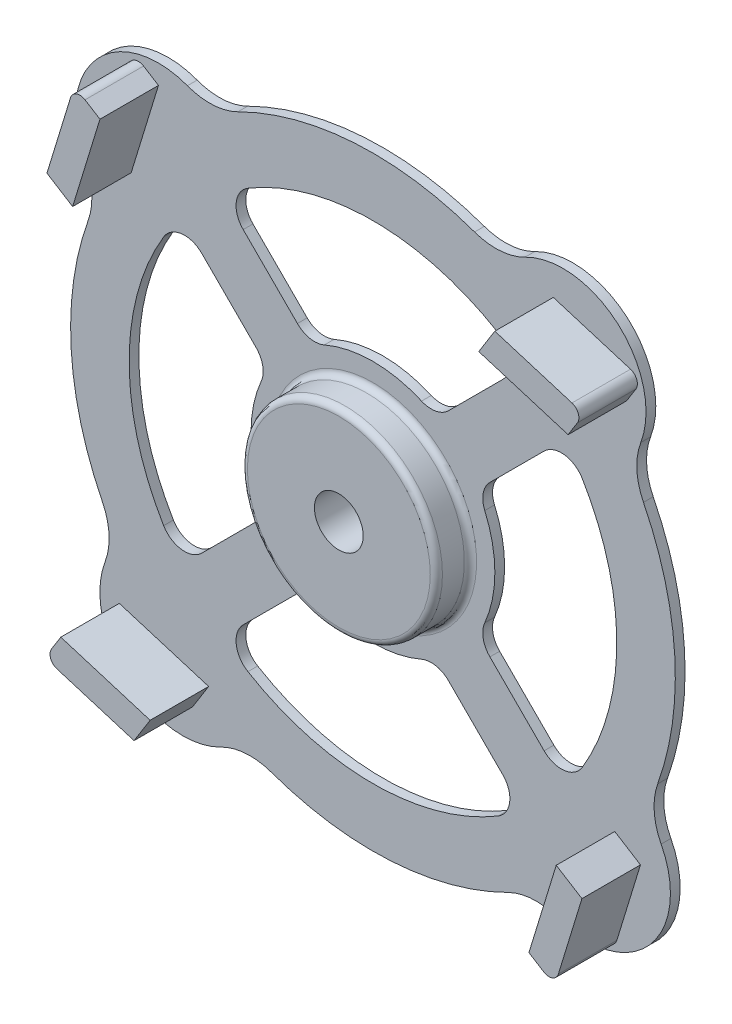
ISO-10303-21;
HEADER;
FILE_DESCRIPTION(('STEP AP214'),'2;1');
FILE_NAME('part.step','',(''),(''),'','','');
FILE_SCHEMA(('AUTOMOTIVE_DESIGN { 1 0 10303 214 1 1 1 1 }'));
ENDSEC;
DATA;
#1=APPLICATION_CONTEXT('core data for automotive mechanical design processes');
#2=APPLICATION_PROTOCOL_DEFINITION('international standard','automotive_design',2000,#1);
#3=PRODUCT_CONTEXT('',#1,'mechanical');
#4=PRODUCT('Part','Part','',(#3));
#5=PRODUCT_RELATED_PRODUCT_CATEGORY('part','',(#4));
#6=PRODUCT_DEFINITION_FORMATION('','',#4);
#7=PRODUCT_DEFINITION_CONTEXT('part definition',#1,'design');
#8=PRODUCT_DEFINITION('design','',#6,#7);
#9=PRODUCT_DEFINITION_SHAPE('','',#8);
#10=(LENGTH_UNIT() NAMED_UNIT(*) SI_UNIT(.MILLI.,.METRE.));
#11=(NAMED_UNIT(*) PLANE_ANGLE_UNIT() SI_UNIT($,.RADIAN.));
#12=(NAMED_UNIT(*) SI_UNIT($,.STERADIAN.) SOLID_ANGLE_UNIT());
#13=UNCERTAINTY_MEASURE_WITH_UNIT(LENGTH_MEASURE(1.E-05),#10,'distance_accuracy_value','');
#14=(GEOMETRIC_REPRESENTATION_CONTEXT(3) GLOBAL_UNCERTAINTY_ASSIGNED_CONTEXT((#13)) GLOBAL_UNIT_ASSIGNED_CONTEXT((#10,
#11,#12)) REPRESENTATION_CONTEXT('',''));
#15=CARTESIAN_POINT('',(0.,0.,0.));
#16=DIRECTION('',(0.,0.,1.));
#17=DIRECTION('',(1.,0.,0.));
#18=AXIS2_PLACEMENT_3D('',#15,#16,#17);
#19=CARTESIAN_POINT('',(-35.319400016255,12.6011897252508,0.));
#20=DIRECTION('',(0.,0.,-1.));
#21=DIRECTION('',(-1.,0.,0.));
#22=AXIS2_PLACEMENT_3D('',#19,#20,#21);
#23=PLANE('',#22);
#24=CARTESIAN_POINT('',(0.,0.,0.));
#25=DIRECTION('',(0.,0.,-1.));
#26=DIRECTION('',(1.,0.,0.));
#27=AXIS2_PLACEMENT_3D('',#24,#25,#26);
#28=CIRCLE('',#27,25.);
#29=CARTESIAN_POINT('',(-22.9282741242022,-9.96464980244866,0.));
#30=VERTEX_POINT('',#29);
#31=CARTESIAN_POINT('',(-22.928274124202,9.96464980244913,0.));
#32=VERTEX_POINT('',#31);
#33=EDGE_CURVE('E609',#30,#32,#28,.T.);
#34=ORIENTED_EDGE('',*,*,#33,.T.);
#35=CARTESIAN_POINT('',(-27.5139289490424,11.957579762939,0.));
#36=DIRECTION('',(0.,0.,1.));
#37=DIRECTION('',(-1.,0.,0.));
#38=AXIS2_PLACEMENT_3D('',#35,#36,#37);
#39=CIRCLE('',#38,5.);
#40=CARTESIAN_POINT('',(-23.9783950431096,15.4931136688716,0.));
#41=VERTEX_POINT('',#40);
#42=EDGE_CURVE('E605',#32,#41,#39,.T.);
#43=ORIENTED_EDGE('',*,*,#42,.T.);
#44=DIRECTION('',(-0.707106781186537,0.707106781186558,0.));
#45=VECTOR('',#44,1.);
#46=CARTESIAN_POINT('',(-23.9783950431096,15.4931136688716,0.));
#47=LINE('',#46,#45);
#48=CARTESIAN_POINT('',(-35.0971379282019,26.6118565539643,0.));
#49=VERTEX_POINT('',#48);
#50=EDGE_CURVE('E627',#41,#49,#47,.T.);
#51=ORIENTED_EDGE('',*,*,#50,.T.);
#52=CARTESIAN_POINT('',(-38.6326718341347,23.0763226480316,0.));
#53=DIRECTION('',(0.,0.,1.));
#54=DIRECTION('',(1.,0.,0.));
#55=AXIS2_PLACEMENT_3D('',#52,#53,#54);
#56=CIRCLE('',#55,4.99999999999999);
#57=CARTESIAN_POINT('',(-42.9251909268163,25.6403584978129,0.));
#58=VERTEX_POINT('',#57);
#59=EDGE_CURVE('E630',#49,#58,#56,.T.);
#60=ORIENTED_EDGE('',*,*,#59,.T.);
#61=CARTESIAN_POINT('',(0.,0.,0.));
#62=DIRECTION('',(0.,0.,1.));
#63=DIRECTION('',(1.,0.,0.));
#64=AXIS2_PLACEMENT_3D('',#61,#62,#63);
#65=CIRCLE('',#64,50.);
#66=CARTESIAN_POINT('',(-42.9251909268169,-25.640358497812,0.));
#67=VERTEX_POINT('',#66);
#68=EDGE_CURVE('E633',#58,#67,#65,.T.);
#69=ORIENTED_EDGE('',*,*,#68,.T.);
#70=CARTESIAN_POINT('',(-38.6326718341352,-23.0763226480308,0.));
#71=DIRECTION('',(0.,0.,1.));
#72=DIRECTION('',(-1.,0.,0.));
#73=AXIS2_PLACEMENT_3D('',#70,#71,#72);
#74=CIRCLE('',#73,4.99999999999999);
#75=CARTESIAN_POINT('',(-35.0971379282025,-26.6118565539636,0.));
#76=VERTEX_POINT('',#75);
#77=EDGE_CURVE('E636',#67,#76,#74,.T.);
#78=ORIENTED_EDGE('',*,*,#77,.T.);
#79=DIRECTION('',(0.707106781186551,0.707106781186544,0.));
#80=VECTOR('',#79,1.);
#81=CARTESIAN_POINT('',(-23.9783950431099,-15.4931136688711,0.));
#82=LINE('',#81,#80);
#83=CARTESIAN_POINT('',(-23.9783950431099,-15.4931136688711,0.));
#84=VERTEX_POINT('',#83);
#85=EDGE_CURVE('E639',#76,#84,#82,.T.);
#86=ORIENTED_EDGE('',*,*,#85,.T.);
#87=CARTESIAN_POINT('',(-27.5139289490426,-11.9575797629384,0.));
#88=DIRECTION('',(0.,0.,1.));
#89=DIRECTION('',(1.,0.,0.));
#90=AXIS2_PLACEMENT_3D('',#87,#88,#89);
#91=CIRCLE('',#90,5.);
#92=EDGE_CURVE('E642',#84,#30,#91,.T.);
#93=ORIENTED_EDGE('',*,*,#92,.T.);
#94=EDGE_LOOP('',(#34,#43,#51,#60,#69,#78,#86,#93));
#95=FACE_BOUND('',#94,.T.);
#96=CARTESIAN_POINT('',(0.,0.,0.));
#97=DIRECTION('',(0.,0.,-1.));
#98=DIRECTION('',(1.,0.,0.));
#99=AXIS2_PLACEMENT_3D('',#96,#97,#98);
#100=CIRCLE('',#99,25.);
#101=CARTESIAN_POINT('',(22.9282741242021,9.96464980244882,0.));
#102=VERTEX_POINT('',#101);
#103=CARTESIAN_POINT('',(22.9282741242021,-9.96464980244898,0.));
#104=VERTEX_POINT('',#103);
#105=EDGE_CURVE('E727',#102,#104,#100,.T.);
#106=ORIENTED_EDGE('',*,*,#105,.T.);
#107=CARTESIAN_POINT('',(27.5139289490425,-11.9575797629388,0.));
#108=DIRECTION('',(0.,0.,1.));
#109=DIRECTION('',(-1.,0.,0.));
#110=AXIS2_PLACEMENT_3D('',#107,#108,#109);
#111=CIRCLE('',#110,5.);
#112=CARTESIAN_POINT('',(23.9783950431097,-15.4931136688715,0.));
#113=VERTEX_POINT('',#112);
#114=EDGE_CURVE('E723',#104,#113,#111,.T.);
#115=ORIENTED_EDGE('',*,*,#114,.T.);
#116=DIRECTION('',(0.707106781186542,-0.707106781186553,0.));
#117=VECTOR('',#116,1.);
#118=CARTESIAN_POINT('',(23.9783950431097,-15.4931136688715,0.));
#119=LINE('',#118,#117);
#120=CARTESIAN_POINT('',(35.0971379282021,-26.611856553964,0.));
#121=VERTEX_POINT('',#120);
#122=EDGE_CURVE('E745',#113,#121,#119,.T.);
#123=ORIENTED_EDGE('',*,*,#122,.T.);
#124=CARTESIAN_POINT('',(38.6326718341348,-23.0763226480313,0.));
#125=DIRECTION('',(0.,0.,1.));
#126=DIRECTION('',(1.,0.,0.));
#127=AXIS2_PLACEMENT_3D('',#124,#125,#126);
#128=CIRCLE('',#127,4.99999999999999);
#129=CARTESIAN_POINT('',(42.9251909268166,-25.6403584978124,0.));
#130=VERTEX_POINT('',#129);
#131=EDGE_CURVE('E748',#121,#130,#128,.T.);
#132=ORIENTED_EDGE('',*,*,#131,.T.);
#133=CARTESIAN_POINT('',(0.,0.,0.));
#134=DIRECTION('',(0.,0.,1.));
#135=DIRECTION('',(1.,0.,0.));
#136=AXIS2_PLACEMENT_3D('',#133,#134,#135);
#137=CIRCLE('',#136,50.);
#138=CARTESIAN_POINT('',(42.9251909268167,25.6403584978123,0.));
#139=VERTEX_POINT('',#138);
#140=EDGE_CURVE('E751',#130,#139,#137,.T.);
#141=ORIENTED_EDGE('',*,*,#140,.T.);
#142=CARTESIAN_POINT('',(38.632671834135,23.0763226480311,0.));
#143=DIRECTION('',(0.,0.,1.));
#144=DIRECTION('',(-1.,0.,0.));
#145=AXIS2_PLACEMENT_3D('',#142,#143,#144);
#146=CIRCLE('',#145,4.99999999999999);
#147=CARTESIAN_POINT('',(35.0971379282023,26.6118565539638,0.));
#148=VERTEX_POINT('',#147);
#149=EDGE_CURVE('E754',#139,#148,#146,.T.);
#150=ORIENTED_EDGE('',*,*,#149,.T.);
#151=DIRECTION('',(-0.707106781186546,-0.707106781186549,0.));
#152=VECTOR('',#151,1.);
#153=CARTESIAN_POINT('',(23.9783950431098,15.4931136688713,0.));
#154=LINE('',#153,#152);
#155=CARTESIAN_POINT('',(23.9783950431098,15.4931136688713,0.));
#156=VERTEX_POINT('',#155);
#157=EDGE_CURVE('E757',#148,#156,#154,.T.);
#158=ORIENTED_EDGE('',*,*,#157,.T.);
#159=CARTESIAN_POINT('',(27.5139289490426,11.9575797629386,0.));
#160=DIRECTION('',(0.,0.,1.));
#161=DIRECTION('',(1.,0.,0.));
#162=AXIS2_PLACEMENT_3D('',#159,#160,#161);
#163=CIRCLE('',#162,5.);
#164=EDGE_CURVE('E760',#156,#102,#163,.T.);
#165=ORIENTED_EDGE('',*,*,#164,.T.);
#166=EDGE_LOOP('',(#106,#115,#123,#132,#141,#150,#158,#165));
#167=FACE_BOUND('',#166,.T.);
#168=CARTESIAN_POINT('',(-70.63880003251,25.2023794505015,0.));
#169=DIRECTION('',(0.,0.,-1.));
#170=DIRECTION('',(-1.,0.,0.));
#171=AXIS2_PLACEMENT_3D('',#168,#169,#170);
#172=CIRCLE('',#171,13.);
#173=CARTESIAN_POINT('',(-59.0953200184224,31.1813483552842,0.));
#174=VERTEX_POINT('',#173);
#175=CARTESIAN_POINT('',(-58.3947413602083,20.8339670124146,0.));
#176=VERTEX_POINT('',#175);
#177=EDGE_CURVE('E841',#174,#176,#172,.T.);
#178=ORIENTED_EDGE('',*,*,#177,.F.);
#179=CARTESIAN_POINT('',(-44.,39.,0.));
#180=DIRECTION('',(0.,0.,1.));
#181=DIRECTION('',(1.,0.,0.));
#182=AXIS2_PLACEMENT_3D('',#179,#180,#181);
#183=CIRCLE('',#182,17.);
#184=CARTESIAN_POINT('',(-38.0500275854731,54.9247552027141,0.));
#185=VERTEX_POINT('',#184);
#186=EDGE_CURVE('E846',#185,#174,#183,.T.);
#187=ORIENTED_EDGE('',*,*,#186,.F.);
#188=CARTESIAN_POINT('',(-33.5000486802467,67.1025091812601,0.));
#189=DIRECTION('',(0.,0.,-1.));
#190=DIRECTION('',(-1.,0.,0.));
#191=AXIS2_PLACEMENT_3D('',#188,#189,#190);
#192=CIRCLE('',#191,13.);
#193=CARTESIAN_POINT('',(-27.6933735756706,55.4714075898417,0.));
#194=VERTEX_POINT('',#193);
#195=EDGE_CURVE('E905',#194,#185,#192,.T.);
#196=ORIENTED_EDGE('',*,*,#195,.F.);
#197=CARTESIAN_POINT('',(0.,0.,0.));
#198=DIRECTION('',(0.,0.,1.));
#199=DIRECTION('',(1.,0.,0.));
#200=AXIS2_PLACEMENT_3D('',#197,#198,#199);
#201=CIRCLE('',#200,62.);
#202=CARTESIAN_POINT('',(20.8339670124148,58.3947413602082,0.));
#203=VERTEX_POINT('',#202);
#204=EDGE_CURVE('E903',#203,#194,#201,.T.);
#205=ORIENTED_EDGE('',*,*,#204,.F.);
#206=CARTESIAN_POINT('',(25.2023794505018,70.63880003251,0.));
#207=DIRECTION('',(0.,0.,-1.));
#208=DIRECTION('',(-1.,0.,0.));
#209=AXIS2_PLACEMENT_3D('',#206,#207,#208);
#210=CIRCLE('',#209,13.);
#211=CARTESIAN_POINT('',(31.1813483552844,59.0953200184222,0.));
#212=VERTEX_POINT('',#211);
#213=EDGE_CURVE('E901',#212,#203,#210,.T.);
#214=ORIENTED_EDGE('',*,*,#213,.F.);
#215=CARTESIAN_POINT('',(39.0000000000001,43.9999999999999,0.));
#216=DIRECTION('',(0.,0.,1.));
#217=DIRECTION('',(1.,0.,0.));
#218=AXIS2_PLACEMENT_3D('',#215,#216,#217);
#219=CIRCLE('',#218,17.);
#220=CARTESIAN_POINT('',(54.9247552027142,38.0500275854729,0.));
#221=VERTEX_POINT('',#220);
#222=EDGE_CURVE('E899',#221,#212,#219,.T.);
#223=ORIENTED_EDGE('',*,*,#222,.F.);
#224=CARTESIAN_POINT('',(67.1025091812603,33.5000486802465,0.));
#225=DIRECTION('',(0.,0.,-1.));
#226=DIRECTION('',(-1.,0.,0.));
#227=AXIS2_PLACEMENT_3D('',#224,#225,#226);
#228=CIRCLE('',#227,13.);
#229=CARTESIAN_POINT('',(55.4714075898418,27.6933735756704,0.));
#230=VERTEX_POINT('',#229);
#231=EDGE_CURVE('E897',#230,#221,#228,.T.);
#232=ORIENTED_EDGE('',*,*,#231,.F.);
#233=CARTESIAN_POINT('',(0.,0.,0.));
#234=DIRECTION('',(0.,0.,1.));
#235=DIRECTION('',(1.,0.,0.));
#236=AXIS2_PLACEMENT_3D('',#233,#234,#235);
#237=CIRCLE('',#236,62.0000000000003);
#238=CARTESIAN_POINT('',(58.3947413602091,-20.8339670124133,0.));
#239=VERTEX_POINT('',#238);
#240=EDGE_CURVE('E895',#239,#230,#237,.T.);
#241=ORIENTED_EDGE('',*,*,#240,.F.);
#242=CARTESIAN_POINT('',(70.6388000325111,-25.2023794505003,0.));
#243=DIRECTION('',(0.,0.,-1.));
#244=DIRECTION('',(-1.,0.,0.));
#245=AXIS2_PLACEMENT_3D('',#242,#243,#244);
#246=CIRCLE('',#245,13.);
#247=CARTESIAN_POINT('',(59.0953200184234,-31.181348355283,0.));
#248=VERTEX_POINT('',#247);
#249=EDGE_CURVE('E893',#248,#239,#246,.T.);
#250=ORIENTED_EDGE('',*,*,#249,.F.);
#251=CARTESIAN_POINT('',(44.0000000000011,-38.9999999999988,0.));
#252=DIRECTION('',(0.,0.,1.));
#253=DIRECTION('',(1.,0.,0.));
#254=AXIS2_PLACEMENT_3D('',#251,#252,#253);
#255=CIRCLE('',#254,17.);
#256=CARTESIAN_POINT('',(38.0500275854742,-54.9247552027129,0.));
#257=VERTEX_POINT('',#256);
#258=EDGE_CURVE('E891',#257,#248,#255,.T.);
#259=ORIENTED_EDGE('',*,*,#258,.F.);
#260=CARTESIAN_POINT('',(33.5000486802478,-67.1025091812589,0.));
#261=DIRECTION('',(0.,0.,-1.));
#262=DIRECTION('',(-1.,0.,0.));
#263=AXIS2_PLACEMENT_3D('',#260,#261,#262);
#264=CIRCLE('',#263,12.9999999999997);
#265=CARTESIAN_POINT('',(27.6933735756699,-55.4714075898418,0.));
#266=VERTEX_POINT('',#265);
#267=EDGE_CURVE('E889',#266,#257,#264,.T.);
#268=ORIENTED_EDGE('',*,*,#267,.F.);
#269=CARTESIAN_POINT('',(0.,0.,0.));
#270=DIRECTION('',(0.,0.,1.));
#271=DIRECTION('',(1.,0.,0.));
#272=AXIS2_PLACEMENT_3D('',#269,#270,#271);
#273=CIRCLE('',#272,62.);
#274=CARTESIAN_POINT('',(-20.8339670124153,-58.3947413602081,0.));
#275=VERTEX_POINT('',#274);
#276=EDGE_CURVE('E887',#275,#266,#273,.T.);
#277=ORIENTED_EDGE('',*,*,#276,.F.);
#278=CARTESIAN_POINT('',(-25.2023794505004,-70.63880003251,0.));
#279=DIRECTION('',(0.,0.,-1.));
#280=DIRECTION('',(-1.,0.,0.));
#281=AXIS2_PLACEMENT_3D('',#278,#279,#280);
#282=CIRCLE('',#281,13.0000000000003);
#283=CARTESIAN_POINT('',(-31.1813483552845,-59.0953200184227,0.));
#284=VERTEX_POINT('',#283);
#285=EDGE_CURVE('E885',#284,#275,#282,.T.);
#286=ORIENTED_EDGE('',*,*,#285,.F.);
#287=CARTESIAN_POINT('',(-39.0000000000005,-43.9999999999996,0.));
#288=DIRECTION('',(0.,0.,1.));
#289=DIRECTION('',(1.,0.,0.));
#290=AXIS2_PLACEMENT_3D('',#287,#288,#289);
#291=CIRCLE('',#290,17.);
#292=CARTESIAN_POINT('',(-54.9247552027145,-38.0500275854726,0.));
#293=VERTEX_POINT('',#292);
#294=EDGE_CURVE('E883',#293,#284,#291,.T.);
#295=ORIENTED_EDGE('',*,*,#294,.F.);
#296=CARTESIAN_POINT('',(-67.1025091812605,-33.500048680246,0.));
#297=DIRECTION('',(0.,0.,-1.));
#298=DIRECTION('',(-1.,0.,0.));
#299=AXIS2_PLACEMENT_3D('',#296,#297,#298);
#300=CIRCLE('',#299,13.);
#301=CARTESIAN_POINT('',(-55.471407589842,-27.69337357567,0.));
#302=VERTEX_POINT('',#301);
#303=EDGE_CURVE('E881',#302,#293,#300,.T.);
#304=ORIENTED_EDGE('',*,*,#303,.F.);
#305=CARTESIAN_POINT('',(0.,0.,0.));
#306=DIRECTION('',(0.,0.,1.));
#307=DIRECTION('',(1.,0.,0.));
#308=AXIS2_PLACEMENT_3D('',#305,#306,#307);
#309=CIRCLE('',#308,62.);
#310=EDGE_CURVE('E879',#176,#302,#309,.T.);
#311=ORIENTED_EDGE('',*,*,#310,.F.);
#312=EDGE_LOOP('',(#178,#187,#196,#205,#214,#223,#232,#241,#250,#259,#268,#277,#286,#295,#304,#311));
#313=FACE_BOUND('',#312,.T.);
#314=CARTESIAN_POINT('',(0.,0.,0.));
#315=DIRECTION('',(0.,0.,-1.));
#316=DIRECTION('',(1.,0.,0.));
#317=AXIS2_PLACEMENT_3D('',#314,#315,#316);
#318=CIRCLE('',#317,25.);
#319=CARTESIAN_POINT('',(-9.9646498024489,22.9282741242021,0.));
#320=VERTEX_POINT('',#319);
#321=CARTESIAN_POINT('',(9.9646498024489,22.9282741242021,0.));
#322=VERTEX_POINT('',#321);
#323=EDGE_CURVE('E786',#320,#322,#318,.T.);
#324=ORIENTED_EDGE('',*,*,#323,.T.);
#325=CARTESIAN_POINT('',(11.9575797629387,27.5139289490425,0.));
#326=DIRECTION('',(0.,0.,1.));
#327=DIRECTION('',(-1.,0.,0.));
#328=AXIS2_PLACEMENT_3D('',#325,#326,#327);
#329=CIRCLE('',#328,5.);
#330=CARTESIAN_POINT('',(15.4931136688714,23.9783950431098,0.));
#331=VERTEX_POINT('',#330);
#332=EDGE_CURVE('E782',#322,#331,#329,.T.);
#333=ORIENTED_EDGE('',*,*,#332,.T.);
#334=DIRECTION('',(0.707106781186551,0.707106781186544,0.));
#335=VECTOR('',#334,1.);
#336=CARTESIAN_POINT('',(15.4931136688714,23.9783950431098,0.));
#337=LINE('',#336,#335);
#338=CARTESIAN_POINT('',(26.6118565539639,35.0971379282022,0.));
#339=VERTEX_POINT('',#338);
#340=EDGE_CURVE('E804',#331,#339,#337,.T.);
#341=ORIENTED_EDGE('',*,*,#340,.T.);
#342=CARTESIAN_POINT('',(23.0763226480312,38.6326718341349,0.));
#343=DIRECTION('',(0.,0.,1.));
#344=DIRECTION('',(1.,0.,0.));
#345=AXIS2_PLACEMENT_3D('',#342,#343,#344);
#346=CIRCLE('',#345,4.99999999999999);
#347=CARTESIAN_POINT('',(25.6403584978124,42.9251909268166,0.));
#348=VERTEX_POINT('',#347);
#349=EDGE_CURVE('E807',#339,#348,#346,.T.);
#350=ORIENTED_EDGE('',*,*,#349,.T.);
#351=CARTESIAN_POINT('',(0.,0.,0.));
#352=DIRECTION('',(0.,0.,1.));
#353=DIRECTION('',(1.,0.,0.));
#354=AXIS2_PLACEMENT_3D('',#351,#352,#353);
#355=CIRCLE('',#354,50.);
#356=CARTESIAN_POINT('',(-25.6403584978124,42.9251909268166,0.));
#357=VERTEX_POINT('',#356);
#358=EDGE_CURVE('E810',#348,#357,#355,.T.);
#359=ORIENTED_EDGE('',*,*,#358,.T.);
#360=CARTESIAN_POINT('',(-23.0763226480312,38.6326718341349,0.));
#361=DIRECTION('',(0.,0.,1.));
#362=DIRECTION('',(-1.,0.,0.));
#363=AXIS2_PLACEMENT_3D('',#360,#361,#362);
#364=CIRCLE('',#363,4.99999999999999);
#365=CARTESIAN_POINT('',(-26.6118565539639,35.0971379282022,0.));
#366=VERTEX_POINT('',#365);
#367=EDGE_CURVE('E813',#357,#366,#364,.T.);
#368=ORIENTED_EDGE('',*,*,#367,.T.);
#369=DIRECTION('',(0.707106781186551,-0.707106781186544,0.));
#370=VECTOR('',#369,1.);
#371=CARTESIAN_POINT('',(-15.4931136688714,23.9783950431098,0.));
#372=LINE('',#371,#370);
#373=CARTESIAN_POINT('',(-15.4931136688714,23.9783950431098,0.));
#374=VERTEX_POINT('',#373);
#375=EDGE_CURVE('E816',#366,#374,#372,.T.);
#376=ORIENTED_EDGE('',*,*,#375,.T.);
#377=CARTESIAN_POINT('',(-11.9575797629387,27.5139289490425,0.));
#378=DIRECTION('',(0.,0.,1.));
#379=DIRECTION('',(1.,0.,0.));
#380=AXIS2_PLACEMENT_3D('',#377,#378,#379);
#381=CIRCLE('',#380,5.);
#382=EDGE_CURVE('E819',#374,#320,#381,.T.);
#383=ORIENTED_EDGE('',*,*,#382,.T.);
#384=EDGE_LOOP('',(#324,#333,#341,#350,#359,#368,#376,#383));
#385=FACE_BOUND('',#384,.T.);
#386=CARTESIAN_POINT('',(0.,0.,0.));
#387=DIRECTION('',(0.,0.,-1.));
#388=DIRECTION('',(1.,0.,0.));
#389=AXIS2_PLACEMENT_3D('',#386,#387,#388);
#390=CIRCLE('',#389,25.);
#391=CARTESIAN_POINT('',(9.96464980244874,-22.9282741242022,0.));
#392=VERTEX_POINT('',#391);
#393=CARTESIAN_POINT('',(-9.96464980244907,-22.928274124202,0.));
#394=VERTEX_POINT('',#393);
#395=EDGE_CURVE('E668',#392,#394,#390,.T.);
#396=ORIENTED_EDGE('',*,*,#395,.T.);
#397=CARTESIAN_POINT('',(-11.9575797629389,-27.5139289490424,0.));
#398=DIRECTION('',(0.,0.,1.));
#399=DIRECTION('',(-1.,0.,0.));
#400=AXIS2_PLACEMENT_3D('',#397,#398,#399);
#401=CIRCLE('',#400,5.);
#402=CARTESIAN_POINT('',(-15.4931136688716,-23.9783950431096,0.));
#403=VERTEX_POINT('',#402);
#404=EDGE_CURVE('E664',#394,#403,#401,.T.);
#405=ORIENTED_EDGE('',*,*,#404,.T.);
#406=DIRECTION('',(-0.707106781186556,-0.707106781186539,0.));
#407=VECTOR('',#406,1.);
#408=CARTESIAN_POINT('',(-15.4931136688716,-23.9783950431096,0.));
#409=LINE('',#408,#407);
#410=CARTESIAN_POINT('',(-26.6118565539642,-35.097137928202,0.));
#411=VERTEX_POINT('',#410);
#412=EDGE_CURVE('E686',#403,#411,#409,.T.);
#413=ORIENTED_EDGE('',*,*,#412,.T.);
#414=CARTESIAN_POINT('',(-23.0763226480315,-38.6326718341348,0.));
#415=DIRECTION('',(0.,0.,1.));
#416=DIRECTION('',(1.,0.,0.));
#417=AXIS2_PLACEMENT_3D('',#414,#415,#416);
#418=CIRCLE('',#417,4.99999999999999);
#419=CARTESIAN_POINT('',(-25.6403584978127,-42.9251909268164,0.));
#420=VERTEX_POINT('',#419);
#421=EDGE_CURVE('E689',#411,#420,#418,.T.);
#422=ORIENTED_EDGE('',*,*,#421,.T.);
#423=CARTESIAN_POINT('',(0.,0.,0.));
#424=DIRECTION('',(0.,0.,1.));
#425=DIRECTION('',(1.,0.,0.));
#426=AXIS2_PLACEMENT_3D('',#423,#424,#425);
#427=CIRCLE('',#426,50.);
#428=CARTESIAN_POINT('',(25.6403584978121,-42.9251909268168,0.));
#429=VERTEX_POINT('',#428);
#430=EDGE_CURVE('E692',#420,#429,#427,.T.);
#431=ORIENTED_EDGE('',*,*,#430,.T.);
#432=CARTESIAN_POINT('',(23.0763226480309,-38.6326718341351,0.));
#433=DIRECTION('',(0.,0.,1.));
#434=DIRECTION('',(-1.,0.,0.));
#435=AXIS2_PLACEMENT_3D('',#432,#433,#434);
#436=CIRCLE('',#435,4.99999999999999);
#437=CARTESIAN_POINT('',(26.6118565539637,-35.0971379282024,0.));
#438=VERTEX_POINT('',#437);
#439=EDGE_CURVE('E695',#429,#438,#436,.T.);
#440=ORIENTED_EDGE('',*,*,#439,.T.);
#441=DIRECTION('',(-0.707106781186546,0.707106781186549,0.));
#442=VECTOR('',#441,1.);
#443=CARTESIAN_POINT('',(15.4931136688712,-23.9783950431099,0.));
#444=LINE('',#443,#442);
#445=CARTESIAN_POINT('',(15.4931136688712,-23.9783950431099,0.));
#446=VERTEX_POINT('',#445);
#447=EDGE_CURVE('E698',#438,#446,#444,.T.);
#448=ORIENTED_EDGE('',*,*,#447,.T.);
#449=CARTESIAN_POINT('',(11.9575797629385,-27.5139289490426,0.));
#450=DIRECTION('',(0.,0.,1.));
#451=DIRECTION('',(1.,0.,0.));
#452=AXIS2_PLACEMENT_3D('',#449,#450,#451);
#453=CIRCLE('',#452,5.);
#454=EDGE_CURVE('E701',#446,#392,#453,.T.);
#455=ORIENTED_EDGE('',*,*,#454,.T.);
#456=EDGE_LOOP('',(#396,#405,#413,#422,#431,#440,#448,#455));
#457=FACE_BOUND('',#456,.T.);
#458=CARTESIAN_POINT('',(0.,0.,0.));
#459=DIRECTION('',(0.,0.,-1.));
#460=DIRECTION('',(-1.,0.,0.));
#461=AXIS2_PLACEMENT_3D('',#458,#459,#460);
#462=CIRCLE('',#461,15.);
#463=CARTESIAN_POINT('',(-15.,0.,0.));
#464=VERTEX_POINT('',#463);
#465=EDGE_CURVE('E994',#464,#464,#462,.T.);
#466=ORIENTED_EDGE('',*,*,#465,.F.);
#467=EDGE_LOOP('',(#466));
#468=FACE_BOUND('',#467,.T.);
#469=ADVANCED_FACE('F31',(#95,#167,#313,#385,#457,#468),#23,.T.);
#470=CARTESIAN_POINT('',(-35.319400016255,12.6011897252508,2.));
#471=DIRECTION('',(0.,0.,-1.));
#472=DIRECTION('',(-1.,0.,0.));
#473=AXIS2_PLACEMENT_3D('',#470,#471,#472);
#474=PLANE('',#473);
#475=CARTESIAN_POINT('',(0.,0.,2.));
#476=DIRECTION('',(0.,0.,-1.));
#477=DIRECTION('',(-1.,0.,0.));
#478=AXIS2_PLACEMENT_3D('',#475,#476,#477);
#479=CIRCLE('',#478,21.25);
#480=CARTESIAN_POINT('',(-21.25,0.,2.));
#481=VERTEX_POINT('',#480);
#482=EDGE_CURVE('E39',#481,#481,#479,.T.);
#483=ORIENTED_EDGE('',*,*,#482,.T.);
#484=EDGE_LOOP('',(#483));
#485=FACE_BOUND('',#484,.T.);
#486=DIRECTION('',(0.956304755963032,-0.292371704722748,0.));
#487=VECTOR('',#486,1.);
#488=CARTESIAN_POINT('',(-36.9878222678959,-54.852605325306,2.));
#489=LINE('',#488,#487);
#490=CARTESIAN_POINT('',(-52.8109924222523,-50.0149767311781,2.));
#491=VERTEX_POINT('',#490);
#492=CARTESIAN_POINT('',(-36.9878222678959,-54.852605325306,2.));
#493=VERTEX_POINT('',#492);
#494=EDGE_CURVE('E476',#491,#493,#489,.T.);
#495=ORIENTED_EDGE('',*,*,#494,.F.);
#496=CARTESIAN_POINT('',(-52.2262490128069,-48.102367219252,2.));
#497=DIRECTION('',(0.,0.,1.));
#498=DIRECTION('',(-1.,0.,0.));
#499=AXIS2_PLACEMENT_3D('',#496,#497,#498);
#500=CIRCLE('',#499,2.);
#501=CARTESIAN_POINT('',(-53.9223452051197,-47.0425286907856,2.));
#502=VERTEX_POINT('',#501);
#503=EDGE_CURVE('E473',#502,#491,#500,.T.);
#504=ORIENTED_EDGE('',*,*,#503,.F.);
#505=DIRECTION('',(-0.529919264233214,-0.84804809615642,0.));
#506=VECTOR('',#505,1.);
#507=CARTESIAN_POINT('',(-53.9223452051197,-47.0425286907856,2.));
#508=LINE('',#507,#506);
#509=CARTESIAN_POINT('',(-52.0118769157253,-43.9851403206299,2.));
#510=VERTEX_POINT('',#509);
#511=EDGE_CURVE('E1005',#510,#502,#508,.T.);
#512=ORIENTED_EDGE('',*,*,#511,.F.);
#513=DIRECTION('',(-0.956304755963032,0.292371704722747,0.));
#514=VECTOR('',#513,1.);
#515=CARTESIAN_POINT('',(-33.6961455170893,-49.5848213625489,2.));
#516=LINE('',#515,#514);
#517=CARTESIAN_POINT('',(-33.6961455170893,-49.5848213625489,2.));
#518=VERTEX_POINT('',#517);
#519=EDGE_CURVE('E51',#518,#510,#516,.T.);
#520=ORIENTED_EDGE('',*,*,#519,.F.);
#521=DIRECTION('',(0.529919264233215,0.84804809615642,0.));
#522=VECTOR('',#521,1.);
#523=CARTESIAN_POINT('',(-36.9878222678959,-54.852605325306,2.));
#524=LINE('',#523,#522);
#525=EDGE_CURVE('E46',#493,#518,#524,.T.);
#526=ORIENTED_EDGE('',*,*,#525,.F.);
#527=EDGE_LOOP('',(#495,#504,#512,#520,#526));
#528=FACE_BOUND('',#527,.T.);
#529=DIRECTION('',(-0.956304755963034,0.292371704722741,0.));
#530=VECTOR('',#529,1.);
#531=CARTESIAN_POINT('',(36.9878222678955,54.8526053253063,2.));
#532=LINE('',#531,#530);
#533=CARTESIAN_POINT('',(52.810992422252,50.0149767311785,2.));
#534=VERTEX_POINT('',#533);
#535=CARTESIAN_POINT('',(36.9878222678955,54.8526053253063,2.));
#536=VERTEX_POINT('',#535);
#537=EDGE_CURVE('E523',#534,#536,#532,.T.);
#538=ORIENTED_EDGE('',*,*,#537,.F.);
#539=CARTESIAN_POINT('',(52.2262490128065,48.1023672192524,2.));
#540=DIRECTION('',(0.,0.,1.));
#541=DIRECTION('',(-1.,0.,0.));
#542=AXIS2_PLACEMENT_3D('',#539,#540,#541);
#543=CIRCLE('',#542,2.);
#544=CARTESIAN_POINT('',(53.9223452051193,47.042528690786,2.));
#545=VERTEX_POINT('',#544);
#546=EDGE_CURVE('E528',#545,#534,#543,.T.);
#547=ORIENTED_EDGE('',*,*,#546,.F.);
#548=DIRECTION('',(0.529919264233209,0.848048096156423,0.));
#549=VECTOR('',#548,1.);
#550=CARTESIAN_POINT('',(53.9223452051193,47.042528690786,2.));
#551=LINE('',#550,#549);
#552=CARTESIAN_POINT('',(52.011876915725,43.9851403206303,2.));
#553=VERTEX_POINT('',#552);
#554=EDGE_CURVE('E545',#553,#545,#551,.T.);
#555=ORIENTED_EDGE('',*,*,#554,.F.);
#556=DIRECTION('',(0.956304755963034,-0.29237170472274,0.));
#557=VECTOR('',#556,1.);
#558=CARTESIAN_POINT('',(33.696145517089,49.5848213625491,2.));
#559=LINE('',#558,#557);
#560=CARTESIAN_POINT('',(33.696145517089,49.5848213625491,2.));
#561=VERTEX_POINT('',#560);
#562=EDGE_CURVE('E542',#561,#553,#559,.T.);
#563=ORIENTED_EDGE('',*,*,#562,.F.);
#564=DIRECTION('',(-0.52991926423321,-0.848048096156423,0.));
#565=VECTOR('',#564,1.);
#566=CARTESIAN_POINT('',(36.9878222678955,54.8526053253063,2.));
#567=LINE('',#566,#565);
#568=EDGE_CURVE('E539',#536,#561,#567,.T.);
#569=ORIENTED_EDGE('',*,*,#568,.F.);
#570=EDGE_LOOP('',(#538,#547,#555,#563,#569));
#571=FACE_BOUND('',#570,.T.);
#572=CARTESIAN_POINT('',(-27.5139289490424,11.957579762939,2.));
#573=DIRECTION('',(0.,0.,1.));
#574=DIRECTION('',(-1.,0.,0.));
#575=AXIS2_PLACEMENT_3D('',#572,#573,#574);
#576=CIRCLE('',#575,5.);
#577=CARTESIAN_POINT('',(-22.928274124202,9.96464980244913,2.));
#578=VERTEX_POINT('',#577);
#579=CARTESIAN_POINT('',(-23.9783950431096,15.4931136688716,2.));
#580=VERTEX_POINT('',#579);
#581=EDGE_CURVE('E606',#578,#580,#576,.T.);
#582=ORIENTED_EDGE('',*,*,#581,.F.);
#583=CARTESIAN_POINT('',(0.,0.,2.));
#584=DIRECTION('',(0.,0.,-1.));
#585=DIRECTION('',(1.,0.,0.));
#586=AXIS2_PLACEMENT_3D('',#583,#584,#585);
#587=CIRCLE('',#586,25.);
#588=CARTESIAN_POINT('',(-22.9282741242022,-9.96464980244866,2.));
#589=VERTEX_POINT('',#588);
#590=EDGE_CURVE('E622',#589,#578,#587,.T.);
#591=ORIENTED_EDGE('',*,*,#590,.F.);
#592=CARTESIAN_POINT('',(-27.5139289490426,-11.9575797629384,2.));
#593=DIRECTION('',(0.,0.,1.));
#594=DIRECTION('',(1.,0.,0.));
#595=AXIS2_PLACEMENT_3D('',#592,#593,#594);
#596=CIRCLE('',#595,5.);
#597=CARTESIAN_POINT('',(-23.9783950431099,-15.4931136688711,2.));
#598=VERTEX_POINT('',#597);
#599=EDGE_CURVE('E619',#598,#589,#596,.T.);
#600=ORIENTED_EDGE('',*,*,#599,.F.);
#601=DIRECTION('',(0.707106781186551,0.707106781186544,0.));
#602=VECTOR('',#601,1.);
#603=CARTESIAN_POINT('',(-23.9783950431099,-15.4931136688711,2.));
#604=LINE('',#603,#602);
#605=CARTESIAN_POINT('',(-35.0971379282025,-26.6118565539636,2.));
#606=VERTEX_POINT('',#605);
#607=EDGE_CURVE('E617',#606,#598,#604,.T.);
#608=ORIENTED_EDGE('',*,*,#607,.F.);
#609=CARTESIAN_POINT('',(-38.6326718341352,-23.0763226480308,2.));
#610=DIRECTION('',(0.,0.,1.));
#611=DIRECTION('',(-1.,0.,0.));
#612=AXIS2_PLACEMENT_3D('',#609,#610,#611);
#613=CIRCLE('',#612,4.99999999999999);
#614=CARTESIAN_POINT('',(-42.9251909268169,-25.640358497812,2.));
#615=VERTEX_POINT('',#614);
#616=EDGE_CURVE('E615',#615,#606,#613,.T.);
#617=ORIENTED_EDGE('',*,*,#616,.F.);
#618=CARTESIAN_POINT('',(0.,0.,2.));
#619=DIRECTION('',(0.,0.,1.));
#620=DIRECTION('',(1.,0.,0.));
#621=AXIS2_PLACEMENT_3D('',#618,#619,#620);
#622=CIRCLE('',#621,50.);
#623=CARTESIAN_POINT('',(-42.9251909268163,25.6403584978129,2.));
#624=VERTEX_POINT('',#623);
#625=EDGE_CURVE('E613',#624,#615,#622,.T.);
#626=ORIENTED_EDGE('',*,*,#625,.F.);
#627=CARTESIAN_POINT('',(-38.6326718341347,23.0763226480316,2.));
#628=DIRECTION('',(0.,0.,1.));
#629=DIRECTION('',(1.,0.,0.));
#630=AXIS2_PLACEMENT_3D('',#627,#628,#629);
#631=CIRCLE('',#630,4.99999999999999);
#632=CARTESIAN_POINT('',(-35.0971379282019,26.6118565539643,2.));
#633=VERTEX_POINT('',#632);
#634=EDGE_CURVE('E611',#633,#624,#631,.T.);
#635=ORIENTED_EDGE('',*,*,#634,.F.);
#636=DIRECTION('',(-0.707106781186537,0.707106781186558,0.));
#637=VECTOR('',#636,1.);
#638=CARTESIAN_POINT('',(-23.9783950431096,15.4931136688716,2.));
#639=LINE('',#638,#637);
#640=EDGE_CURVE('E608',#580,#633,#639,.T.);
#641=ORIENTED_EDGE('',*,*,#640,.F.);
#642=EDGE_LOOP('',(#582,#591,#600,#608,#617,#626,#635,#641));
#643=FACE_BOUND('',#642,.T.);
#644=CARTESIAN_POINT('',(27.5139289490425,-11.9575797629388,2.));
#645=DIRECTION('',(0.,0.,1.));
#646=DIRECTION('',(-1.,0.,0.));
#647=AXIS2_PLACEMENT_3D('',#644,#645,#646);
#648=CIRCLE('',#647,5.);
#649=CARTESIAN_POINT('',(22.9282741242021,-9.96464980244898,2.));
#650=VERTEX_POINT('',#649);
#651=CARTESIAN_POINT('',(23.9783950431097,-15.4931136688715,2.));
#652=VERTEX_POINT('',#651);
#653=EDGE_CURVE('E724',#650,#652,#648,.T.);
#654=ORIENTED_EDGE('',*,*,#653,.F.);
#655=CARTESIAN_POINT('',(0.,0.,2.));
#656=DIRECTION('',(0.,0.,-1.));
#657=DIRECTION('',(1.,0.,0.));
#658=AXIS2_PLACEMENT_3D('',#655,#656,#657);
#659=CIRCLE('',#658,25.);
#660=CARTESIAN_POINT('',(22.9282741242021,9.96464980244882,2.));
#661=VERTEX_POINT('',#660);
#662=EDGE_CURVE('E740',#661,#650,#659,.T.);
#663=ORIENTED_EDGE('',*,*,#662,.F.);
#664=CARTESIAN_POINT('',(27.5139289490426,11.9575797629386,2.));
#665=DIRECTION('',(0.,0.,1.));
#666=DIRECTION('',(1.,0.,0.));
#667=AXIS2_PLACEMENT_3D('',#664,#665,#666);
#668=CIRCLE('',#667,5.);
#669=CARTESIAN_POINT('',(23.9783950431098,15.4931136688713,2.));
#670=VERTEX_POINT('',#669);
#671=EDGE_CURVE('E737',#670,#661,#668,.T.);
#672=ORIENTED_EDGE('',*,*,#671,.F.);
#673=DIRECTION('',(-0.707106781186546,-0.707106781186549,0.));
#674=VECTOR('',#673,1.);
#675=CARTESIAN_POINT('',(23.9783950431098,15.4931136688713,2.));
#676=LINE('',#675,#674);
#677=CARTESIAN_POINT('',(35.0971379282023,26.6118565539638,2.));
#678=VERTEX_POINT('',#677);
#679=EDGE_CURVE('E735',#678,#670,#676,.T.);
#680=ORIENTED_EDGE('',*,*,#679,.F.);
#681=CARTESIAN_POINT('',(38.632671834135,23.0763226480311,2.));
#682=DIRECTION('',(0.,0.,1.));
#683=DIRECTION('',(-1.,0.,0.));
#684=AXIS2_PLACEMENT_3D('',#681,#682,#683);
#685=CIRCLE('',#684,4.99999999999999);
#686=CARTESIAN_POINT('',(42.9251909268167,25.6403584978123,2.));
#687=VERTEX_POINT('',#686);
#688=EDGE_CURVE('E733',#687,#678,#685,.T.);
#689=ORIENTED_EDGE('',*,*,#688,.F.);
#690=CARTESIAN_POINT('',(0.,0.,2.));
#691=DIRECTION('',(0.,0.,1.));
#692=DIRECTION('',(1.,0.,0.));
#693=AXIS2_PLACEMENT_3D('',#690,#691,#692);
#694=CIRCLE('',#693,50.);
#695=CARTESIAN_POINT('',(42.9251909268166,-25.6403584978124,2.));
#696=VERTEX_POINT('',#695);
#697=EDGE_CURVE('E731',#696,#687,#694,.T.);
#698=ORIENTED_EDGE('',*,*,#697,.F.);
#699=CARTESIAN_POINT('',(38.6326718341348,-23.0763226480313,2.));
#700=DIRECTION('',(0.,0.,1.));
#701=DIRECTION('',(1.,0.,0.));
#702=AXIS2_PLACEMENT_3D('',#699,#700,#701);
#703=CIRCLE('',#702,4.99999999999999);
#704=CARTESIAN_POINT('',(35.0971379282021,-26.611856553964,2.));
#705=VERTEX_POINT('',#704);
#706=EDGE_CURVE('E729',#705,#696,#703,.T.);
#707=ORIENTED_EDGE('',*,*,#706,.F.);
#708=DIRECTION('',(0.707106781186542,-0.707106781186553,0.));
#709=VECTOR('',#708,1.);
#710=CARTESIAN_POINT('',(23.9783950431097,-15.4931136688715,2.));
#711=LINE('',#710,#709);
#712=EDGE_CURVE('E726',#652,#705,#711,.T.);
#713=ORIENTED_EDGE('',*,*,#712,.F.);
#714=EDGE_LOOP('',(#654,#663,#672,#680,#689,#698,#707,#713));
#715=FACE_BOUND('',#714,.T.);
#716=CARTESIAN_POINT('',(-70.63880003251,25.2023794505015,2.));
#717=DIRECTION('',(0.,0.,-1.));
#718=DIRECTION('',(-1.,0.,0.));
#719=AXIS2_PLACEMENT_3D('',#716,#717,#718);
#720=CIRCLE('',#719,13.);
#721=CARTESIAN_POINT('',(-59.0953200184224,31.1813483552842,2.));
#722=VERTEX_POINT('',#721);
#723=CARTESIAN_POINT('',(-58.3947413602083,20.8339670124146,2.));
#724=VERTEX_POINT('',#723);
#725=EDGE_CURVE('E842',#722,#724,#720,.T.);
#726=ORIENTED_EDGE('',*,*,#725,.T.);
#727=CARTESIAN_POINT('',(0.,0.,2.));
#728=DIRECTION('',(0.,0.,1.));
#729=DIRECTION('',(1.,0.,0.));
#730=AXIS2_PLACEMENT_3D('',#727,#728,#729);
#731=CIRCLE('',#730,62.);
#732=CARTESIAN_POINT('',(-55.471407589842,-27.69337357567,2.));
#733=VERTEX_POINT('',#732);
#734=EDGE_CURVE('E845',#724,#733,#731,.T.);
#735=ORIENTED_EDGE('',*,*,#734,.T.);
#736=CARTESIAN_POINT('',(-67.1025091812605,-33.500048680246,2.));
#737=DIRECTION('',(0.,0.,-1.));
#738=DIRECTION('',(-1.,0.,0.));
#739=AXIS2_PLACEMENT_3D('',#736,#737,#738);
#740=CIRCLE('',#739,13.);
#741=CARTESIAN_POINT('',(-54.9247552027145,-38.0500275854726,2.));
#742=VERTEX_POINT('',#741);
#743=EDGE_CURVE('E848',#733,#742,#740,.T.);
#744=ORIENTED_EDGE('',*,*,#743,.T.);
#745=CARTESIAN_POINT('',(-39.0000000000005,-43.9999999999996,2.));
#746=DIRECTION('',(0.,0.,1.));
#747=DIRECTION('',(1.,0.,0.));
#748=AXIS2_PLACEMENT_3D('',#745,#746,#747);
#749=CIRCLE('',#748,17.);
#750=CARTESIAN_POINT('',(-31.1813483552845,-59.0953200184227,2.));
#751=VERTEX_POINT('',#750);
#752=EDGE_CURVE('E850',#742,#751,#749,.T.);
#753=ORIENTED_EDGE('',*,*,#752,.T.);
#754=CARTESIAN_POINT('',(-25.2023794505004,-70.63880003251,2.));
#755=DIRECTION('',(0.,0.,-1.));
#756=DIRECTION('',(-1.,0.,0.));
#757=AXIS2_PLACEMENT_3D('',#754,#755,#756);
#758=CIRCLE('',#757,13.0000000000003);
#759=CARTESIAN_POINT('',(-20.8339670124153,-58.3947413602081,2.));
#760=VERTEX_POINT('',#759);
#761=EDGE_CURVE('E852',#751,#760,#758,.T.);
#762=ORIENTED_EDGE('',*,*,#761,.T.);
#763=CARTESIAN_POINT('',(0.,0.,2.));
#764=DIRECTION('',(0.,0.,1.));
#765=DIRECTION('',(1.,0.,0.));
#766=AXIS2_PLACEMENT_3D('',#763,#764,#765);
#767=CIRCLE('',#766,62.);
#768=CARTESIAN_POINT('',(27.6933735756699,-55.4714075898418,2.));
#769=VERTEX_POINT('',#768);
#770=EDGE_CURVE('E854',#760,#769,#767,.T.);
#771=ORIENTED_EDGE('',*,*,#770,.T.);
#772=CARTESIAN_POINT('',(33.5000486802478,-67.1025091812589,2.));
#773=DIRECTION('',(0.,0.,-1.));
#774=DIRECTION('',(-1.,0.,0.));
#775=AXIS2_PLACEMENT_3D('',#772,#773,#774);
#776=CIRCLE('',#775,12.9999999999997);
#777=CARTESIAN_POINT('',(38.0500275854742,-54.9247552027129,2.));
#778=VERTEX_POINT('',#777);
#779=EDGE_CURVE('E856',#769,#778,#776,.T.);
#780=ORIENTED_EDGE('',*,*,#779,.T.);
#781=CARTESIAN_POINT('',(44.0000000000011,-38.9999999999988,2.));
#782=DIRECTION('',(0.,0.,1.));
#783=DIRECTION('',(1.,0.,0.));
#784=AXIS2_PLACEMENT_3D('',#781,#782,#783);
#785=CIRCLE('',#784,17.);
#786=CARTESIAN_POINT('',(59.0953200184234,-31.181348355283,2.));
#787=VERTEX_POINT('',#786);
#788=EDGE_CURVE('E858',#778,#787,#785,.T.);
#789=ORIENTED_EDGE('',*,*,#788,.T.);
#790=CARTESIAN_POINT('',(70.6388000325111,-25.2023794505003,2.));
#791=DIRECTION('',(0.,0.,-1.));
#792=DIRECTION('',(-1.,0.,0.));
#793=AXIS2_PLACEMENT_3D('',#790,#791,#792);
#794=CIRCLE('',#793,13.);
#795=CARTESIAN_POINT('',(58.3947413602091,-20.8339670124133,2.));
#796=VERTEX_POINT('',#795);
#797=EDGE_CURVE('E860',#787,#796,#794,.T.);
#798=ORIENTED_EDGE('',*,*,#797,.T.);
#799=CARTESIAN_POINT('',(0.,0.,2.));
#800=DIRECTION('',(0.,0.,1.));
#801=DIRECTION('',(1.,0.,0.));
#802=AXIS2_PLACEMENT_3D('',#799,#800,#801);
#803=CIRCLE('',#802,62.0000000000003);
#804=CARTESIAN_POINT('',(55.4714075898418,27.6933735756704,2.));
#805=VERTEX_POINT('',#804);
#806=EDGE_CURVE('E862',#796,#805,#803,.T.);
#807=ORIENTED_EDGE('',*,*,#806,.T.);
#808=CARTESIAN_POINT('',(67.1025091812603,33.5000486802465,2.));
#809=DIRECTION('',(0.,0.,-1.));
#810=DIRECTION('',(-1.,0.,0.));
#811=AXIS2_PLACEMENT_3D('',#808,#809,#810);
#812=CIRCLE('',#811,13.);
#813=CARTESIAN_POINT('',(54.9247552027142,38.0500275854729,2.));
#814=VERTEX_POINT('',#813);
#815=EDGE_CURVE('E864',#805,#814,#812,.T.);
#816=ORIENTED_EDGE('',*,*,#815,.T.);
#817=CARTESIAN_POINT('',(39.0000000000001,43.9999999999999,2.));
#818=DIRECTION('',(0.,0.,1.));
#819=DIRECTION('',(1.,0.,0.));
#820=AXIS2_PLACEMENT_3D('',#817,#818,#819);
#821=CIRCLE('',#820,17.);
#822=CARTESIAN_POINT('',(31.1813483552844,59.0953200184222,2.));
#823=VERTEX_POINT('',#822);
#824=EDGE_CURVE('E866',#814,#823,#821,.T.);
#825=ORIENTED_EDGE('',*,*,#824,.T.);
#826=CARTESIAN_POINT('',(25.2023794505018,70.63880003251,2.));
#827=DIRECTION('',(0.,0.,-1.));
#828=DIRECTION('',(-1.,0.,0.));
#829=AXIS2_PLACEMENT_3D('',#826,#827,#828);
#830=CIRCLE('',#829,13.);
#831=CARTESIAN_POINT('',(20.8339670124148,58.3947413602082,2.));
#832=VERTEX_POINT('',#831);
#833=EDGE_CURVE('E868',#823,#832,#830,.T.);
#834=ORIENTED_EDGE('',*,*,#833,.T.);
#835=CARTESIAN_POINT('',(0.,0.,2.));
#836=DIRECTION('',(0.,0.,1.));
#837=DIRECTION('',(1.,0.,0.));
#838=AXIS2_PLACEMENT_3D('',#835,#836,#837);
#839=CIRCLE('',#838,62.);
#840=CARTESIAN_POINT('',(-27.6933735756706,55.4714075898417,2.));
#841=VERTEX_POINT('',#840);
#842=EDGE_CURVE('E870',#832,#841,#839,.T.);
#843=ORIENTED_EDGE('',*,*,#842,.T.);
#844=CARTESIAN_POINT('',(-33.5000486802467,67.1025091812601,2.));
#845=DIRECTION('',(0.,0.,-1.));
#846=DIRECTION('',(-1.,0.,0.));
#847=AXIS2_PLACEMENT_3D('',#844,#845,#846);
#848=CIRCLE('',#847,13.);
#849=CARTESIAN_POINT('',(-38.0500275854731,54.9247552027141,2.));
#850=VERTEX_POINT('',#849);
#851=EDGE_CURVE('E872',#841,#850,#848,.T.);
#852=ORIENTED_EDGE('',*,*,#851,.T.);
#853=CARTESIAN_POINT('',(-44.,39.,2.));
#854=DIRECTION('',(0.,0.,1.));
#855=DIRECTION('',(1.,0.,0.));
#856=AXIS2_PLACEMENT_3D('',#853,#854,#855);
#857=CIRCLE('',#856,17.);
#858=EDGE_CURVE('E874',#850,#722,#857,.T.);
#859=ORIENTED_EDGE('',*,*,#858,.T.);
#860=EDGE_LOOP('',(#726,#735,#744,#753,#762,#771,#780,#789,#798,#807,#816,#825,#834,#843,#852,#859));
#861=FACE_BOUND('',#860,.T.);
#862=CARTESIAN_POINT('',(11.9575797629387,27.5139289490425,2.));
#863=DIRECTION('',(0.,0.,1.));
#864=DIRECTION('',(-1.,0.,0.));
#865=AXIS2_PLACEMENT_3D('',#862,#863,#864);
#866=CIRCLE('',#865,5.);
#867=CARTESIAN_POINT('',(9.9646498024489,22.9282741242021,2.));
#868=VERTEX_POINT('',#867);
#869=CARTESIAN_POINT('',(15.4931136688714,23.9783950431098,2.));
#870=VERTEX_POINT('',#869);
#871=EDGE_CURVE('E783',#868,#870,#866,.T.);
#872=ORIENTED_EDGE('',*,*,#871,.F.);
#873=CARTESIAN_POINT('',(0.,0.,2.));
#874=DIRECTION('',(0.,0.,-1.));
#875=DIRECTION('',(1.,0.,0.));
#876=AXIS2_PLACEMENT_3D('',#873,#874,#875);
#877=CIRCLE('',#876,25.);
#878=CARTESIAN_POINT('',(-9.9646498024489,22.9282741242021,2.));
#879=VERTEX_POINT('',#878);
#880=EDGE_CURVE('E799',#879,#868,#877,.T.);
#881=ORIENTED_EDGE('',*,*,#880,.F.);
#882=CARTESIAN_POINT('',(-11.9575797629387,27.5139289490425,2.));
#883=DIRECTION('',(0.,0.,1.));
#884=DIRECTION('',(1.,0.,0.));
#885=AXIS2_PLACEMENT_3D('',#882,#883,#884);
#886=CIRCLE('',#885,5.);
#887=CARTESIAN_POINT('',(-15.4931136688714,23.9783950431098,2.));
#888=VERTEX_POINT('',#887);
#889=EDGE_CURVE('E796',#888,#879,#886,.T.);
#890=ORIENTED_EDGE('',*,*,#889,.F.);
#891=DIRECTION('',(0.707106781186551,-0.707106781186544,0.));
#892=VECTOR('',#891,1.);
#893=CARTESIAN_POINT('',(-15.4931136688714,23.9783950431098,2.));
#894=LINE('',#893,#892);
#895=CARTESIAN_POINT('',(-26.6118565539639,35.0971379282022,2.));
#896=VERTEX_POINT('',#895);
#897=EDGE_CURVE('E794',#896,#888,#894,.T.);
#898=ORIENTED_EDGE('',*,*,#897,.F.);
#899=CARTESIAN_POINT('',(-23.0763226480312,38.6326718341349,2.));
#900=DIRECTION('',(0.,0.,1.));
#901=DIRECTION('',(-1.,0.,0.));
#902=AXIS2_PLACEMENT_3D('',#899,#900,#901);
#903=CIRCLE('',#902,4.99999999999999);
#904=CARTESIAN_POINT('',(-25.6403584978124,42.9251909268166,2.));
#905=VERTEX_POINT('',#904);
#906=EDGE_CURVE('E792',#905,#896,#903,.T.);
#907=ORIENTED_EDGE('',*,*,#906,.F.);
#908=CARTESIAN_POINT('',(0.,0.,2.));
#909=DIRECTION('',(0.,0.,1.));
#910=DIRECTION('',(1.,0.,0.));
#911=AXIS2_PLACEMENT_3D('',#908,#909,#910);
#912=CIRCLE('',#911,50.);
#913=CARTESIAN_POINT('',(25.6403584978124,42.9251909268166,2.));
#914=VERTEX_POINT('',#913);
#915=EDGE_CURVE('E790',#914,#905,#912,.T.);
#916=ORIENTED_EDGE('',*,*,#915,.F.);
#917=CARTESIAN_POINT('',(23.0763226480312,38.6326718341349,2.));
#918=DIRECTION('',(0.,0.,1.));
#919=DIRECTION('',(1.,0.,0.));
#920=AXIS2_PLACEMENT_3D('',#917,#918,#919);
#921=CIRCLE('',#920,4.99999999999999);
#922=CARTESIAN_POINT('',(26.6118565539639,35.0971379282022,2.));
#923=VERTEX_POINT('',#922);
#924=EDGE_CURVE('E788',#923,#914,#921,.T.);
#925=ORIENTED_EDGE('',*,*,#924,.F.);
#926=DIRECTION('',(0.707106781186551,0.707106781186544,0.));
#927=VECTOR('',#926,1.);
#928=CARTESIAN_POINT('',(15.4931136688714,23.9783950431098,2.));
#929=LINE('',#928,#927);
#930=EDGE_CURVE('E785',#870,#923,#929,.T.);
#931=ORIENTED_EDGE('',*,*,#930,.F.);
#932=EDGE_LOOP('',(#872,#881,#890,#898,#907,#916,#925,#931));
#933=FACE_BOUND('',#932,.T.);
#934=CARTESIAN_POINT('',(-11.9575797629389,-27.5139289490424,2.));
#935=DIRECTION('',(0.,0.,1.));
#936=DIRECTION('',(-1.,0.,0.));
#937=AXIS2_PLACEMENT_3D('',#934,#935,#936);
#938=CIRCLE('',#937,5.);
#939=CARTESIAN_POINT('',(-9.96464980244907,-22.928274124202,2.));
#940=VERTEX_POINT('',#939);
#941=CARTESIAN_POINT('',(-15.4931136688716,-23.9783950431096,2.));
#942=VERTEX_POINT('',#941);
#943=EDGE_CURVE('E665',#940,#942,#938,.T.);
#944=ORIENTED_EDGE('',*,*,#943,.F.);
#945=CARTESIAN_POINT('',(0.,0.,2.));
#946=DIRECTION('',(0.,0.,-1.));
#947=DIRECTION('',(1.,0.,0.));
#948=AXIS2_PLACEMENT_3D('',#945,#946,#947);
#949=CIRCLE('',#948,25.);
#950=CARTESIAN_POINT('',(9.96464980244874,-22.9282741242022,2.));
#951=VERTEX_POINT('',#950);
#952=EDGE_CURVE('E681',#951,#940,#949,.T.);
#953=ORIENTED_EDGE('',*,*,#952,.F.);
#954=CARTESIAN_POINT('',(11.9575797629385,-27.5139289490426,2.));
#955=DIRECTION('',(0.,0.,1.));
#956=DIRECTION('',(1.,0.,0.));
#957=AXIS2_PLACEMENT_3D('',#954,#955,#956);
#958=CIRCLE('',#957,5.);
#959=CARTESIAN_POINT('',(15.4931136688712,-23.9783950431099,2.));
#960=VERTEX_POINT('',#959);
#961=EDGE_CURVE('E678',#960,#951,#958,.T.);
#962=ORIENTED_EDGE('',*,*,#961,.F.);
#963=DIRECTION('',(-0.707106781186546,0.707106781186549,0.));
#964=VECTOR('',#963,1.);
#965=CARTESIAN_POINT('',(15.4931136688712,-23.9783950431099,2.));
#966=LINE('',#965,#964);
#967=CARTESIAN_POINT('',(26.6118565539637,-35.0971379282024,2.));
#968=VERTEX_POINT('',#967);
#969=EDGE_CURVE('E676',#968,#960,#966,.T.);
#970=ORIENTED_EDGE('',*,*,#969,.F.);
#971=CARTESIAN_POINT('',(23.0763226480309,-38.6326718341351,2.));
#972=DIRECTION('',(0.,0.,1.));
#973=DIRECTION('',(-1.,0.,0.));
#974=AXIS2_PLACEMENT_3D('',#971,#972,#973);
#975=CIRCLE('',#974,4.99999999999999);
#976=CARTESIAN_POINT('',(25.6403584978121,-42.9251909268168,2.));
#977=VERTEX_POINT('',#976);
#978=EDGE_CURVE('E674',#977,#968,#975,.T.);
#979=ORIENTED_EDGE('',*,*,#978,.F.);
#980=CARTESIAN_POINT('',(0.,0.,2.));
#981=DIRECTION('',(0.,0.,1.));
#982=DIRECTION('',(1.,0.,0.));
#983=AXIS2_PLACEMENT_3D('',#980,#981,#982);
#984=CIRCLE('',#983,50.);
#985=CARTESIAN_POINT('',(-25.6403584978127,-42.9251909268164,2.));
#986=VERTEX_POINT('',#985);
#987=EDGE_CURVE('E672',#986,#977,#984,.T.);
#988=ORIENTED_EDGE('',*,*,#987,.F.);
#989=CARTESIAN_POINT('',(-23.0763226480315,-38.6326718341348,2.));
#990=DIRECTION('',(0.,0.,1.));
#991=DIRECTION('',(1.,0.,0.));
#992=AXIS2_PLACEMENT_3D('',#989,#990,#991);
#993=CIRCLE('',#992,4.99999999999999);
#994=CARTESIAN_POINT('',(-26.6118565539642,-35.097137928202,2.));
#995=VERTEX_POINT('',#994);
#996=EDGE_CURVE('E670',#995,#986,#993,.T.);
#997=ORIENTED_EDGE('',*,*,#996,.F.);
#998=DIRECTION('',(-0.707106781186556,-0.707106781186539,0.));
#999=VECTOR('',#998,1.);
#1000=CARTESIAN_POINT('',(-15.4931136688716,-23.9783950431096,2.));
#1001=LINE('',#1000,#999);
#1002=EDGE_CURVE('E667',#942,#995,#1001,.T.);
#1003=ORIENTED_EDGE('',*,*,#1002,.F.);
#1004=EDGE_LOOP('',(#944,#953,#962,#970,#979,#988,#997,#1003));
#1005=FACE_BOUND('',#1004,.T.);
#1006=DIRECTION('',(-0.292371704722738,-0.956304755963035,0.));
#1007=VECTOR('',#1006,1.);
#1008=CARTESIAN_POINT('',(-54.8526053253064,36.9878222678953,2.));
#1009=LINE('',#1008,#1007);
#1010=CARTESIAN_POINT('',(-50.0149767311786,52.8109924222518,2.));
#1011=VERTEX_POINT('',#1010);
#1012=CARTESIAN_POINT('',(-54.8526053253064,36.9878222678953,2.));
#1013=VERTEX_POINT('',#1012);
#1014=EDGE_CURVE('E564',#1011,#1013,#1009,.T.);
#1015=ORIENTED_EDGE('',*,*,#1014,.F.);
#1016=CARTESIAN_POINT('',(-48.1023672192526,52.2262490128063,2.));
#1017=DIRECTION('',(0.,0.,1.));
#1018=DIRECTION('',(-1.,0.,0.));
#1019=AXIS2_PLACEMENT_3D('',#1016,#1017,#1018);
#1020=CIRCLE('',#1019,2.);
#1021=CARTESIAN_POINT('',(-47.0425286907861,53.9223452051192,2.));
#1022=VERTEX_POINT('',#1021);
#1023=EDGE_CURVE('E569',#1022,#1011,#1020,.T.);
#1024=ORIENTED_EDGE('',*,*,#1023,.F.);
#1025=DIRECTION('',(-0.848048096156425,0.529919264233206,0.));
#1026=VECTOR('',#1025,1.);
#1027=CARTESIAN_POINT('',(-47.0425286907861,53.9223452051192,2.));
#1028=LINE('',#1027,#1026);
#1029=CARTESIAN_POINT('',(-43.9851403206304,52.0118769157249,2.));
#1030=VERTEX_POINT('',#1029);
#1031=EDGE_CURVE('E586',#1030,#1022,#1028,.T.);
#1032=ORIENTED_EDGE('',*,*,#1031,.F.);
#1033=DIRECTION('',(0.292371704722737,0.956304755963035,0.));
#1034=VECTOR('',#1033,1.);
#1035=CARTESIAN_POINT('',(-49.5848213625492,33.6961455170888,2.));
#1036=LINE('',#1035,#1034);
#1037=CARTESIAN_POINT('',(-49.5848213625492,33.6961455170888,2.));
#1038=VERTEX_POINT('',#1037);
#1039=EDGE_CURVE('E583',#1038,#1030,#1036,.T.);
#1040=ORIENTED_EDGE('',*,*,#1039,.F.);
#1041=DIRECTION('',(0.848048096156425,-0.529919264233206,0.));
#1042=VECTOR('',#1041,1.);
#1043=CARTESIAN_POINT('',(-54.8526053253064,36.9878222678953,2.));
#1044=LINE('',#1043,#1042);
#1045=EDGE_CURVE('E580',#1013,#1038,#1044,.T.);
#1046=ORIENTED_EDGE('',*,*,#1045,.F.);
#1047=EDGE_LOOP('',(#1015,#1024,#1032,#1040,#1046));
#1048=FACE_BOUND('',#1047,.T.);
#1049=DIRECTION('',(0.292371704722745,0.956304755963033,0.));
#1050=VECTOR('',#1049,1.);
#1051=CARTESIAN_POINT('',(54.8526053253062,-36.9878222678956,2.));
#1052=LINE('',#1051,#1050);
#1053=CARTESIAN_POINT('',(50.0149767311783,-52.8109924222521,2.));
#1054=VERTEX_POINT('',#1053);
#1055=CARTESIAN_POINT('',(54.8526053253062,-36.9878222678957,2.));
#1056=VERTEX_POINT('',#1055);
#1057=EDGE_CURVE('E477',#1054,#1056,#1052,.T.);
#1058=ORIENTED_EDGE('',*,*,#1057,.F.);
#1059=CARTESIAN_POINT('',(48.1023672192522,-52.2262490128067,2.));
#1060=DIRECTION('',(0.,0.,1.));
#1061=DIRECTION('',(-1.,0.,0.));
#1062=AXIS2_PLACEMENT_3D('',#1059,#1060,#1061);
#1063=CIRCLE('',#1062,2.);
#1064=CARTESIAN_POINT('',(47.0425286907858,-53.9223452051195,2.));
#1065=VERTEX_POINT('',#1064);
#1066=EDGE_CURVE('E490',#1065,#1054,#1063,.T.);
#1067=ORIENTED_EDGE('',*,*,#1066,.F.);
#1068=DIRECTION('',(0.848048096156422,-0.529919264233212,0.));
#1069=VECTOR('',#1068,1.);
#1070=CARTESIAN_POINT('',(47.0425286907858,-53.9223452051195,2.));
#1071=LINE('',#1070,#1069);
#1072=CARTESIAN_POINT('',(43.9851403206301,-52.0118769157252,2.));
#1073=VERTEX_POINT('',#1072);
#1074=EDGE_CURVE('E504',#1073,#1065,#1071,.T.);
#1075=ORIENTED_EDGE('',*,*,#1074,.F.);
#1076=DIRECTION('',(-0.292371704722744,-0.956304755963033,0.));
#1077=VECTOR('',#1076,1.);
#1078=CARTESIAN_POINT('',(49.584821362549,-33.6961455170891,2.));
#1079=LINE('',#1078,#1077);
#1080=CARTESIAN_POINT('',(49.584821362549,-33.6961455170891,2.));
#1081=VERTEX_POINT('',#1080);
#1082=EDGE_CURVE('E501',#1081,#1073,#1079,.T.);
#1083=ORIENTED_EDGE('',*,*,#1082,.F.);
#1084=DIRECTION('',(-0.848048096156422,0.529919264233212,0.));
#1085=VECTOR('',#1084,1.);
#1086=CARTESIAN_POINT('',(54.8526053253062,-36.9878222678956,2.));
#1087=LINE('',#1086,#1085);
#1088=EDGE_CURVE('E480',#1056,#1081,#1087,.T.);
#1089=ORIENTED_EDGE('',*,*,#1088,.F.);
#1090=EDGE_LOOP('',(#1058,#1067,#1075,#1083,#1089));
#1091=FACE_BOUND('',#1090,.T.);
#1092=ADVANCED_FACE('F963',(#485,#528,#571,#643,#715,#861,#933,#1005,#1048,#1091),#474,.F.);
#1093=CARTESIAN_POINT('',(-70.63880003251,25.2023794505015,2.));
#1094=DIRECTION('',(0.,0.,-1.));
#1095=DIRECTION('',(-1.,0.,0.));
#1096=AXIS2_PLACEMENT_3D('',#1093,#1094,#1095);
#1097=CYLINDRICAL_SURFACE('',#1096,13.);
#1098=ORIENTED_EDGE('',*,*,#177,.T.);
#1099=DIRECTION('',(0.,0.,-1.));
#1100=VECTOR('',#1099,1.);
#1101=CARTESIAN_POINT('',(-58.3947413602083,20.8339670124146,2.));
#1102=LINE('',#1101,#1100);
#1103=EDGE_CURVE('E952',#724,#176,#1102,.T.);
#1104=ORIENTED_EDGE('',*,*,#1103,.F.);
#1105=ORIENTED_EDGE('',*,*,#725,.F.);
#1106=DIRECTION('',(0.,0.,-1.));
#1107=VECTOR('',#1106,1.);
#1108=CARTESIAN_POINT('',(-59.0953200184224,31.1813483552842,2.));
#1109=LINE('',#1108,#1107);
#1110=EDGE_CURVE('E876',#722,#174,#1109,.T.);
#1111=ORIENTED_EDGE('',*,*,#1110,.T.);
#1112=EDGE_LOOP('',(#1098,#1104,#1105,#1111));
#1113=FACE_BOUND('',#1112,.T.);
#1114=ADVANCED_FACE('F1025',(#1113),#1097,.F.);
#1115=CARTESIAN_POINT('',(0.,0.,2.));
#1116=DIRECTION('',(0.,0.,-1.));
#1117=DIRECTION('',(-1.,0.,0.));
#1118=AXIS2_PLACEMENT_3D('',#1115,#1116,#1117);
#1119=CYLINDRICAL_SURFACE('',#1118,62.);
#1120=ORIENTED_EDGE('',*,*,#310,.T.);
#1121=DIRECTION('',(0.,0.,-1.));
#1122=VECTOR('',#1121,1.);
#1123=CARTESIAN_POINT('',(-55.471407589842,-27.69337357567,2.));
#1124=LINE('',#1123,#1122);
#1125=EDGE_CURVE('E949',#733,#302,#1124,.T.);
#1126=ORIENTED_EDGE('',*,*,#1125,.F.);
#1127=ORIENTED_EDGE('',*,*,#734,.F.);
#1128=ORIENTED_EDGE('',*,*,#1103,.T.);
#1129=EDGE_LOOP('',(#1120,#1126,#1127,#1128));
#1130=FACE_BOUND('',#1129,.T.);
#1131=ADVANCED_FACE('F1144',(#1130),#1119,.T.);
#1132=CARTESIAN_POINT('',(-67.1025091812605,-33.500048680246,2.));
#1133=DIRECTION('',(0.,0.,-1.));
#1134=DIRECTION('',(-1.,0.,0.));
#1135=AXIS2_PLACEMENT_3D('',#1132,#1133,#1134);
#1136=CYLINDRICAL_SURFACE('',#1135,13.);
#1137=ORIENTED_EDGE('',*,*,#303,.T.);
#1138=DIRECTION('',(0.,0.,-1.));
#1139=VECTOR('',#1138,1.);
#1140=CARTESIAN_POINT('',(-54.9247552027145,-38.0500275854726,2.));
#1141=LINE('',#1140,#1139);
#1142=EDGE_CURVE('E946',#742,#293,#1141,.T.);
#1143=ORIENTED_EDGE('',*,*,#1142,.F.);
#1144=ORIENTED_EDGE('',*,*,#743,.F.);
#1145=ORIENTED_EDGE('',*,*,#1125,.T.);
#1146=EDGE_LOOP('',(#1137,#1143,#1144,#1145));
#1147=FACE_BOUND('',#1146,.T.);
#1148=ADVANCED_FACE('F1140',(#1147),#1136,.F.);
#1149=CARTESIAN_POINT('',(-39.0000000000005,-43.9999999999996,2.));
#1150=DIRECTION('',(0.,0.,-1.));
#1151=DIRECTION('',(-1.,0.,0.));
#1152=AXIS2_PLACEMENT_3D('',#1149,#1150,#1151);
#1153=CYLINDRICAL_SURFACE('',#1152,17.);
#1154=ORIENTED_EDGE('',*,*,#294,.T.);
#1155=DIRECTION('',(0.,0.,-1.));
#1156=VECTOR('',#1155,1.);
#1157=CARTESIAN_POINT('',(-31.1813483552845,-59.0953200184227,2.));
#1158=LINE('',#1157,#1156);
#1159=EDGE_CURVE('E943',#751,#284,#1158,.T.);
#1160=ORIENTED_EDGE('',*,*,#1159,.F.);
#1161=ORIENTED_EDGE('',*,*,#752,.F.);
#1162=ORIENTED_EDGE('',*,*,#1142,.T.);
#1163=EDGE_LOOP('',(#1154,#1160,#1161,#1162));
#1164=FACE_BOUND('',#1163,.T.);
#1165=ADVANCED_FACE('F1136',(#1164),#1153,.T.);
#1166=CARTESIAN_POINT('',(-25.2023794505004,-70.63880003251,2.));
#1167=DIRECTION('',(0.,0.,-1.));
#1168=DIRECTION('',(-1.,0.,0.));
#1169=AXIS2_PLACEMENT_3D('',#1166,#1167,#1168);
#1170=CYLINDRICAL_SURFACE('',#1169,13.0000000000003);
#1171=ORIENTED_EDGE('',*,*,#285,.T.);
#1172=DIRECTION('',(0.,0.,-1.));
#1173=VECTOR('',#1172,1.);
#1174=CARTESIAN_POINT('',(-20.8339670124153,-58.3947413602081,2.));
#1175=LINE('',#1174,#1173);
#1176=EDGE_CURVE('E940',#760,#275,#1175,.T.);
#1177=ORIENTED_EDGE('',*,*,#1176,.F.);
#1178=ORIENTED_EDGE('',*,*,#761,.F.);
#1179=ORIENTED_EDGE('',*,*,#1159,.T.);
#1180=EDGE_LOOP('',(#1171,#1177,#1178,#1179));
#1181=FACE_BOUND('',#1180,.T.);
#1182=ADVANCED_FACE('F1132',(#1181),#1170,.F.);
#1183=CARTESIAN_POINT('',(0.,0.,2.));
#1184=DIRECTION('',(0.,0.,-1.));
#1185=DIRECTION('',(-1.,0.,0.));
#1186=AXIS2_PLACEMENT_3D('',#1183,#1184,#1185);
#1187=CYLINDRICAL_SURFACE('',#1186,62.);
#1188=ORIENTED_EDGE('',*,*,#276,.T.);
#1189=DIRECTION('',(0.,0.,-1.));
#1190=VECTOR('',#1189,1.);
#1191=CARTESIAN_POINT('',(27.6933735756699,-55.4714075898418,2.));
#1192=LINE('',#1191,#1190);
#1193=EDGE_CURVE('E937',#769,#266,#1192,.T.);
#1194=ORIENTED_EDGE('',*,*,#1193,.F.);
#1195=ORIENTED_EDGE('',*,*,#770,.F.);
#1196=ORIENTED_EDGE('',*,*,#1176,.T.);
#1197=EDGE_LOOP('',(#1188,#1194,#1195,#1196));
#1198=FACE_BOUND('',#1197,.T.);
#1199=ADVANCED_FACE('F1128',(#1198),#1187,.T.);
#1200=CARTESIAN_POINT('',(33.5000486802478,-67.1025091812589,2.));
#1201=DIRECTION('',(0.,0.,-1.));
#1202=DIRECTION('',(-1.,0.,0.));
#1203=AXIS2_PLACEMENT_3D('',#1200,#1201,#1202);
#1204=CYLINDRICAL_SURFACE('',#1203,12.9999999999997);
#1205=ORIENTED_EDGE('',*,*,#267,.T.);
#1206=DIRECTION('',(0.,0.,-1.));
#1207=VECTOR('',#1206,1.);
#1208=CARTESIAN_POINT('',(38.0500275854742,-54.9247552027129,2.));
#1209=LINE('',#1208,#1207);
#1210=EDGE_CURVE('E934',#778,#257,#1209,.T.);
#1211=ORIENTED_EDGE('',*,*,#1210,.F.);
#1212=ORIENTED_EDGE('',*,*,#779,.F.);
#1213=ORIENTED_EDGE('',*,*,#1193,.T.);
#1214=EDGE_LOOP('',(#1205,#1211,#1212,#1213));
#1215=FACE_BOUND('',#1214,.T.);
#1216=ADVANCED_FACE('F1124',(#1215),#1204,.F.);
#1217=CARTESIAN_POINT('',(44.0000000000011,-38.9999999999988,2.));
#1218=DIRECTION('',(0.,0.,-1.));
#1219=DIRECTION('',(-1.,0.,0.));
#1220=AXIS2_PLACEMENT_3D('',#1217,#1218,#1219);
#1221=CYLINDRICAL_SURFACE('',#1220,17.);
#1222=ORIENTED_EDGE('',*,*,#258,.T.);
#1223=DIRECTION('',(0.,0.,-1.));
#1224=VECTOR('',#1223,1.);
#1225=CARTESIAN_POINT('',(59.0953200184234,-31.181348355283,2.));
#1226=LINE('',#1225,#1224);
#1227=EDGE_CURVE('E931',#787,#248,#1226,.T.);
#1228=ORIENTED_EDGE('',*,*,#1227,.F.);
#1229=ORIENTED_EDGE('',*,*,#788,.F.);
#1230=ORIENTED_EDGE('',*,*,#1210,.T.);
#1231=EDGE_LOOP('',(#1222,#1228,#1229,#1230));
#1232=FACE_BOUND('',#1231,.T.);
#1233=ADVANCED_FACE('F1120',(#1232),#1221,.T.);
#1234=CARTESIAN_POINT('',(70.6388000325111,-25.2023794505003,2.));
#1235=DIRECTION('',(0.,0.,-1.));
#1236=DIRECTION('',(-1.,0.,0.));
#1237=AXIS2_PLACEMENT_3D('',#1234,#1235,#1236);
#1238=CYLINDRICAL_SURFACE('',#1237,13.);
#1239=ORIENTED_EDGE('',*,*,#249,.T.);
#1240=DIRECTION('',(0.,0.,-1.));
#1241=VECTOR('',#1240,1.);
#1242=CARTESIAN_POINT('',(58.3947413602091,-20.8339670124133,2.));
#1243=LINE('',#1242,#1241);
#1244=EDGE_CURVE('E928',#796,#239,#1243,.T.);
#1245=ORIENTED_EDGE('',*,*,#1244,.F.);
#1246=ORIENTED_EDGE('',*,*,#797,.F.);
#1247=ORIENTED_EDGE('',*,*,#1227,.T.);
#1248=EDGE_LOOP('',(#1239,#1245,#1246,#1247));
#1249=FACE_BOUND('',#1248,.T.);
#1250=ADVANCED_FACE('F1116',(#1249),#1238,.F.);
#1251=CARTESIAN_POINT('',(0.,0.,2.));
#1252=DIRECTION('',(0.,0.,-1.));
#1253=DIRECTION('',(-1.,0.,0.));
#1254=AXIS2_PLACEMENT_3D('',#1251,#1252,#1253);
#1255=CYLINDRICAL_SURFACE('',#1254,62.0000000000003);
#1256=ORIENTED_EDGE('',*,*,#240,.T.);
#1257=DIRECTION('',(0.,0.,-1.));
#1258=VECTOR('',#1257,1.);
#1259=CARTESIAN_POINT('',(55.4714075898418,27.6933735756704,2.));
#1260=LINE('',#1259,#1258);
#1261=EDGE_CURVE('E925',#805,#230,#1260,.T.);
#1262=ORIENTED_EDGE('',*,*,#1261,.F.);
#1263=ORIENTED_EDGE('',*,*,#806,.F.);
#1264=ORIENTED_EDGE('',*,*,#1244,.T.);
#1265=EDGE_LOOP('',(#1256,#1262,#1263,#1264));
#1266=FACE_BOUND('',#1265,.T.);
#1267=ADVANCED_FACE('F1112',(#1266),#1255,.T.);
#1268=CARTESIAN_POINT('',(67.1025091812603,33.5000486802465,2.));
#1269=DIRECTION('',(0.,0.,-1.));
#1270=DIRECTION('',(-1.,0.,0.));
#1271=AXIS2_PLACEMENT_3D('',#1268,#1269,#1270);
#1272=CYLINDRICAL_SURFACE('',#1271,13.);
#1273=ORIENTED_EDGE('',*,*,#231,.T.);
#1274=DIRECTION('',(0.,0.,-1.));
#1275=VECTOR('',#1274,1.);
#1276=CARTESIAN_POINT('',(54.9247552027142,38.0500275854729,2.));
#1277=LINE('',#1276,#1275);
#1278=EDGE_CURVE('E922',#814,#221,#1277,.T.);
#1279=ORIENTED_EDGE('',*,*,#1278,.F.);
#1280=ORIENTED_EDGE('',*,*,#815,.F.);
#1281=ORIENTED_EDGE('',*,*,#1261,.T.);
#1282=EDGE_LOOP('',(#1273,#1279,#1280,#1281));
#1283=FACE_BOUND('',#1282,.T.);
#1284=ADVANCED_FACE('F1108',(#1283),#1272,.F.);
#1285=CARTESIAN_POINT('',(39.0000000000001,43.9999999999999,2.));
#1286=DIRECTION('',(0.,0.,-1.));
#1287=DIRECTION('',(-1.,0.,0.));
#1288=AXIS2_PLACEMENT_3D('',#1285,#1286,#1287);
#1289=CYLINDRICAL_SURFACE('',#1288,17.);
#1290=ORIENTED_EDGE('',*,*,#222,.T.);
#1291=DIRECTION('',(0.,0.,-1.));
#1292=VECTOR('',#1291,1.);
#1293=CARTESIAN_POINT('',(31.1813483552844,59.0953200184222,2.));
#1294=LINE('',#1293,#1292);
#1295=EDGE_CURVE('E919',#823,#212,#1294,.T.);
#1296=ORIENTED_EDGE('',*,*,#1295,.F.);
#1297=ORIENTED_EDGE('',*,*,#824,.F.);
#1298=ORIENTED_EDGE('',*,*,#1278,.T.);
#1299=EDGE_LOOP('',(#1290,#1296,#1297,#1298));
#1300=FACE_BOUND('',#1299,.T.);
#1301=ADVANCED_FACE('F1104',(#1300),#1289,.T.);
#1302=CARTESIAN_POINT('',(25.2023794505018,70.63880003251,2.));
#1303=DIRECTION('',(0.,0.,-1.));
#1304=DIRECTION('',(-1.,0.,0.));
#1305=AXIS2_PLACEMENT_3D('',#1302,#1303,#1304);
#1306=CYLINDRICAL_SURFACE('',#1305,13.);
#1307=ORIENTED_EDGE('',*,*,#213,.T.);
#1308=DIRECTION('',(0.,0.,-1.));
#1309=VECTOR('',#1308,1.);
#1310=CARTESIAN_POINT('',(20.8339670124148,58.3947413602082,2.));
#1311=LINE('',#1310,#1309);
#1312=EDGE_CURVE('E916',#832,#203,#1311,.T.);
#1313=ORIENTED_EDGE('',*,*,#1312,.F.);
#1314=ORIENTED_EDGE('',*,*,#833,.F.);
#1315=ORIENTED_EDGE('',*,*,#1295,.T.);
#1316=EDGE_LOOP('',(#1307,#1313,#1314,#1315));
#1317=FACE_BOUND('',#1316,.T.);
#1318=ADVANCED_FACE('F1100',(#1317),#1306,.F.);
#1319=CARTESIAN_POINT('',(0.,0.,2.));
#1320=DIRECTION('',(0.,0.,-1.));
#1321=DIRECTION('',(-1.,0.,0.));
#1322=AXIS2_PLACEMENT_3D('',#1319,#1320,#1321);
#1323=CYLINDRICAL_SURFACE('',#1322,62.);
#1324=ORIENTED_EDGE('',*,*,#204,.T.);
#1325=DIRECTION('',(0.,0.,-1.));
#1326=VECTOR('',#1325,1.);
#1327=CARTESIAN_POINT('',(-27.6933735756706,55.4714075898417,2.));
#1328=LINE('',#1327,#1326);
#1329=EDGE_CURVE('E913',#841,#194,#1328,.T.);
#1330=ORIENTED_EDGE('',*,*,#1329,.F.);
#1331=ORIENTED_EDGE('',*,*,#842,.F.);
#1332=ORIENTED_EDGE('',*,*,#1312,.T.);
#1333=EDGE_LOOP('',(#1324,#1330,#1331,#1332));
#1334=FACE_BOUND('',#1333,.T.);
#1335=ADVANCED_FACE('F1096',(#1334),#1323,.T.);
#1336=CARTESIAN_POINT('',(-33.5000486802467,67.1025091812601,2.));
#1337=DIRECTION('',(0.,0.,-1.));
#1338=DIRECTION('',(-1.,0.,0.));
#1339=AXIS2_PLACEMENT_3D('',#1336,#1337,#1338);
#1340=CYLINDRICAL_SURFACE('',#1339,13.);
#1341=ORIENTED_EDGE('',*,*,#195,.T.);
#1342=DIRECTION('',(0.,0.,-1.));
#1343=VECTOR('',#1342,1.);
#1344=CARTESIAN_POINT('',(-38.0500275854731,54.9247552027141,2.));
#1345=LINE('',#1344,#1343);
#1346=EDGE_CURVE('E910',#850,#185,#1345,.T.);
#1347=ORIENTED_EDGE('',*,*,#1346,.F.);
#1348=ORIENTED_EDGE('',*,*,#851,.F.);
#1349=ORIENTED_EDGE('',*,*,#1329,.T.);
#1350=EDGE_LOOP('',(#1341,#1347,#1348,#1349));
#1351=FACE_BOUND('',#1350,.T.);
#1352=ADVANCED_FACE('F1092',(#1351),#1340,.F.);
#1353=CARTESIAN_POINT('',(-44.,39.,2.));
#1354=DIRECTION('',(0.,0.,-1.));
#1355=DIRECTION('',(-1.,0.,0.));
#1356=AXIS2_PLACEMENT_3D('',#1353,#1354,#1355);
#1357=CYLINDRICAL_SURFACE('',#1356,17.);
#1358=ORIENTED_EDGE('',*,*,#186,.T.);
#1359=ORIENTED_EDGE('',*,*,#1110,.F.);
#1360=ORIENTED_EDGE('',*,*,#858,.F.);
#1361=ORIENTED_EDGE('',*,*,#1346,.T.);
#1362=EDGE_LOOP('',(#1358,#1359,#1360,#1361));
#1363=FACE_BOUND('',#1362,.T.);
#1364=ADVANCED_FACE('F1088',(#1363),#1357,.T.);
#1365=CARTESIAN_POINT('',(0.,0.,2.));
#1366=DIRECTION('',(0.,0.,-1.));
#1367=DIRECTION('',(-1.,0.,0.));
#1368=AXIS2_PLACEMENT_3D('',#1365,#1366,#1367);
#1369=CYLINDRICAL_SURFACE('',#1368,5.);
#1370=CARTESIAN_POINT('',(0.,0.,9.));
#1371=DIRECTION('',(0.,0.,1.));
#1372=DIRECTION('',(1.,0.,0.));
#1373=AXIS2_PLACEMENT_3D('',#1370,#1371,#1372);
#1374=CIRCLE('',#1373,5.);
#1375=CARTESIAN_POINT('',(5.,0.,9.));
#1376=VERTEX_POINT('',#1375);
#1377=EDGE_CURVE('E988',#1376,#1376,#1374,.T.);
#1378=ORIENTED_EDGE('',*,*,#1377,.T.);
#1379=EDGE_LOOP('',(#1378));
#1380=FACE_BOUND('',#1379,.T.);
#1381=CARTESIAN_POINT('',(0.,0.,-1.));
#1382=DIRECTION('',(0.,0.,-1.));
#1383=DIRECTION('',(-1.,0.,0.));
#1384=AXIS2_PLACEMENT_3D('',#1381,#1382,#1383);
#1385=CIRCLE('',#1384,5.);
#1386=CARTESIAN_POINT('',(-5.,0.,-1.));
#1387=VERTEX_POINT('',#1386);
#1388=EDGE_CURVE('E1206',#1387,#1387,#1385,.T.);
#1389=ORIENTED_EDGE('',*,*,#1388,.T.);
#1390=EDGE_LOOP('',(#1389));
#1391=FACE_BOUND('',#1390,.T.);
#1392=ADVANCED_FACE('F1091',(#1380,#1391),#1369,.F.);
#1393=CARTESIAN_POINT('',(11.9575797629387,27.5139289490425,2.));
#1394=DIRECTION('',(0.,0.,-1.));
#1395=DIRECTION('',(-1.,0.,0.));
#1396=AXIS2_PLACEMENT_3D('',#1393,#1394,#1395);
#1397=CYLINDRICAL_SURFACE('',#1396,5.);
#1398=ORIENTED_EDGE('',*,*,#332,.F.);
#1399=DIRECTION('',(0.,0.,-1.));
#1400=VECTOR('',#1399,1.);
#1401=CARTESIAN_POINT('',(9.9646498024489,22.9282741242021,2.));
#1402=LINE('',#1401,#1400);
#1403=EDGE_CURVE('E801',#868,#322,#1402,.T.);
#1404=ORIENTED_EDGE('',*,*,#1403,.F.);
#1405=ORIENTED_EDGE('',*,*,#871,.T.);
#1406=DIRECTION('',(0.,0.,-1.));
#1407=VECTOR('',#1406,1.);
#1408=CARTESIAN_POINT('',(15.4931136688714,23.9783950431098,2.));
#1409=LINE('',#1408,#1407);
#1410=EDGE_CURVE('E838',#870,#331,#1409,.T.);
#1411=ORIENTED_EDGE('',*,*,#1410,.T.);
#1412=EDGE_LOOP('',(#1398,#1404,#1405,#1411));
#1413=FACE_BOUND('',#1412,.T.);
#1414=ADVANCED_FACE('F1321',(#1413),#1397,.F.);
#1415=CARTESIAN_POINT('',(15.4931136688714,23.9783950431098,2.));
#1416=DIRECTION('',(-0.707106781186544,0.707106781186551,0.));
#1417=DIRECTION('',(-0.707106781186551,-0.707106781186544,0.));
#1418=AXIS2_PLACEMENT_3D('',#1415,#1416,#1417);
#1419=PLANE('',#1418);
#1420=ORIENTED_EDGE('',*,*,#340,.F.);
#1421=ORIENTED_EDGE('',*,*,#1410,.F.);
#1422=ORIENTED_EDGE('',*,*,#930,.T.);
#1423=DIRECTION('',(0.,0.,-1.));
#1424=VECTOR('',#1423,1.);
#1425=CARTESIAN_POINT('',(26.6118565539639,35.0971379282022,2.));
#1426=LINE('',#1425,#1424);
#1427=EDGE_CURVE('E836',#923,#339,#1426,.T.);
#1428=ORIENTED_EDGE('',*,*,#1427,.T.);
#1429=EDGE_LOOP('',(#1420,#1421,#1422,#1428));
#1430=FACE_BOUND('',#1429,.T.);
#1431=ADVANCED_FACE('F1753',(#1430),#1419,.T.);
#1432=CARTESIAN_POINT('',(23.0763226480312,38.6326718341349,2.));
#1433=DIRECTION('',(0.,0.,-1.));
#1434=DIRECTION('',(-1.,0.,0.));
#1435=AXIS2_PLACEMENT_3D('',#1432,#1433,#1434);
#1436=CYLINDRICAL_SURFACE('',#1435,4.99999999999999);
#1437=ORIENTED_EDGE('',*,*,#349,.F.);
#1438=ORIENTED_EDGE('',*,*,#1427,.F.);
#1439=ORIENTED_EDGE('',*,*,#924,.T.);
#1440=DIRECTION('',(0.,0.,-1.));
#1441=VECTOR('',#1440,1.);
#1442=CARTESIAN_POINT('',(25.6403584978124,42.9251909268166,2.));
#1443=LINE('',#1442,#1441);
#1444=EDGE_CURVE('E834',#914,#348,#1443,.T.);
#1445=ORIENTED_EDGE('',*,*,#1444,.T.);
#1446=EDGE_LOOP('',(#1437,#1438,#1439,#1445));
#1447=FACE_BOUND('',#1446,.T.);
#1448=ADVANCED_FACE('F1744',(#1447),#1436,.F.);
#1449=CARTESIAN_POINT('',(0.,0.,2.));
#1450=DIRECTION('',(0.,0.,-1.));
#1451=DIRECTION('',(-1.,0.,0.));
#1452=AXIS2_PLACEMENT_3D('',#1449,#1450,#1451);
#1453=CYLINDRICAL_SURFACE('',#1452,50.);
#1454=ORIENTED_EDGE('',*,*,#358,.F.);
#1455=ORIENTED_EDGE('',*,*,#1444,.F.);
#1456=ORIENTED_EDGE('',*,*,#915,.T.);
#1457=DIRECTION('',(0.,0.,-1.));
#1458=VECTOR('',#1457,1.);
#1459=CARTESIAN_POINT('',(-25.6403584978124,42.9251909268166,2.));
#1460=LINE('',#1459,#1458);
#1461=EDGE_CURVE('E832',#905,#357,#1460,.T.);
#1462=ORIENTED_EDGE('',*,*,#1461,.T.);
#1463=EDGE_LOOP('',(#1454,#1455,#1456,#1462));
#1464=FACE_BOUND('',#1463,.T.);
#1465=ADVANCED_FACE('F1735',(#1464),#1453,.F.);
#1466=CARTESIAN_POINT('',(-23.0763226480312,38.6326718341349,2.));
#1467=DIRECTION('',(0.,0.,-1.));
#1468=DIRECTION('',(-1.,0.,0.));
#1469=AXIS2_PLACEMENT_3D('',#1466,#1467,#1468);
#1470=CYLINDRICAL_SURFACE('',#1469,4.99999999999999);
#1471=ORIENTED_EDGE('',*,*,#367,.F.);
#1472=ORIENTED_EDGE('',*,*,#1461,.F.);
#1473=ORIENTED_EDGE('',*,*,#906,.T.);
#1474=DIRECTION('',(0.,0.,-1.));
#1475=VECTOR('',#1474,1.);
#1476=CARTESIAN_POINT('',(-26.6118565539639,35.0971379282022,2.));
#1477=LINE('',#1476,#1475);
#1478=EDGE_CURVE('E830',#896,#366,#1477,.T.);
#1479=ORIENTED_EDGE('',*,*,#1478,.T.);
#1480=EDGE_LOOP('',(#1471,#1472,#1473,#1479));
#1481=FACE_BOUND('',#1480,.T.);
#1482=ADVANCED_FACE('F1726',(#1481),#1470,.F.);
#1483=CARTESIAN_POINT('',(-15.4931136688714,23.9783950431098,2.));
#1484=DIRECTION('',(0.707106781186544,0.707106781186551,0.));
#1485=DIRECTION('',(-0.707106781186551,0.707106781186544,0.));
#1486=AXIS2_PLACEMENT_3D('',#1483,#1484,#1485);
#1487=PLANE('',#1486);
#1488=ORIENTED_EDGE('',*,*,#375,.F.);
#1489=ORIENTED_EDGE('',*,*,#1478,.F.);
#1490=ORIENTED_EDGE('',*,*,#897,.T.);
#1491=DIRECTION('',(0.,0.,-1.));
#1492=VECTOR('',#1491,1.);
#1493=CARTESIAN_POINT('',(-15.4931136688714,23.9783950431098,2.));
#1494=LINE('',#1493,#1492);
#1495=EDGE_CURVE('E828',#888,#374,#1494,.T.);
#1496=ORIENTED_EDGE('',*,*,#1495,.T.);
#1497=EDGE_LOOP('',(#1488,#1489,#1490,#1496));
#1498=FACE_BOUND('',#1497,.T.);
#1499=ADVANCED_FACE('F1717',(#1498),#1487,.T.);
#1500=CARTESIAN_POINT('',(-11.9575797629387,27.5139289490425,2.));
#1501=DIRECTION('',(0.,0.,-1.));
#1502=DIRECTION('',(-1.,0.,0.));
#1503=AXIS2_PLACEMENT_3D('',#1500,#1501,#1502);
#1504=CYLINDRICAL_SURFACE('',#1503,5.);
#1505=ORIENTED_EDGE('',*,*,#382,.F.);
#1506=ORIENTED_EDGE('',*,*,#1495,.F.);
#1507=ORIENTED_EDGE('',*,*,#889,.T.);
#1508=DIRECTION('',(0.,0.,-1.));
#1509=VECTOR('',#1508,1.);
#1510=CARTESIAN_POINT('',(-9.9646498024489,22.9282741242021,2.));
#1511=LINE('',#1510,#1509);
#1512=EDGE_CURVE('E826',#879,#320,#1511,.T.);
#1513=ORIENTED_EDGE('',*,*,#1512,.T.);
#1514=EDGE_LOOP('',(#1505,#1506,#1507,#1513));
#1515=FACE_BOUND('',#1514,.T.);
#1516=ADVANCED_FACE('F1708',(#1515),#1504,.F.);
#1517=CARTESIAN_POINT('',(0.,0.,2.));
#1518=DIRECTION('',(0.,0.,-1.));
#1519=DIRECTION('',(-1.,0.,0.));
#1520=AXIS2_PLACEMENT_3D('',#1517,#1518,#1519);
#1521=CYLINDRICAL_SURFACE('',#1520,25.);
#1522=ORIENTED_EDGE('',*,*,#323,.F.);
#1523=ORIENTED_EDGE('',*,*,#1512,.F.);
#1524=ORIENTED_EDGE('',*,*,#880,.T.);
#1525=ORIENTED_EDGE('',*,*,#1403,.T.);
#1526=EDGE_LOOP('',(#1522,#1523,#1524,#1525));
#1527=FACE_BOUND('',#1526,.T.);
#1528=ADVANCED_FACE('F1699',(#1527),#1521,.T.);
#1529=CARTESIAN_POINT('',(27.5139289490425,-11.9575797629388,2.));
#1530=DIRECTION('',(0.,0.,-1.));
#1531=DIRECTION('',(-1.,0.,0.));
#1532=AXIS2_PLACEMENT_3D('',#1529,#1530,#1531);
#1533=CYLINDRICAL_SURFACE('',#1532,5.);
#1534=ORIENTED_EDGE('',*,*,#114,.F.);
#1535=DIRECTION('',(0.,0.,-1.));
#1536=VECTOR('',#1535,1.);
#1537=CARTESIAN_POINT('',(22.9282741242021,-9.96464980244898,2.));
#1538=LINE('',#1537,#1536);
#1539=EDGE_CURVE('E742',#650,#104,#1538,.T.);
#1540=ORIENTED_EDGE('',*,*,#1539,.F.);
#1541=ORIENTED_EDGE('',*,*,#653,.T.);
#1542=DIRECTION('',(0.,0.,-1.));
#1543=VECTOR('',#1542,1.);
#1544=CARTESIAN_POINT('',(23.9783950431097,-15.4931136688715,2.));
#1545=LINE('',#1544,#1543);
#1546=EDGE_CURVE('E779',#652,#113,#1545,.T.);
#1547=ORIENTED_EDGE('',*,*,#1546,.T.);
#1548=EDGE_LOOP('',(#1534,#1540,#1541,#1547));
#1549=FACE_BOUND('',#1548,.T.);
#1550=ADVANCED_FACE('F1690',(#1549),#1533,.F.);
#1551=CARTESIAN_POINT('',(23.9783950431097,-15.4931136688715,2.));
#1552=DIRECTION('',(0.707106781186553,0.707106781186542,0.));
#1553=DIRECTION('',(-0.707106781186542,0.707106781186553,0.));
#1554=AXIS2_PLACEMENT_3D('',#1551,#1552,#1553);
#1555=PLANE('',#1554);
#1556=ORIENTED_EDGE('',*,*,#122,.F.);
#1557=ORIENTED_EDGE('',*,*,#1546,.F.);
#1558=ORIENTED_EDGE('',*,*,#712,.T.);
#1559=DIRECTION('',(0.,0.,-1.));
#1560=VECTOR('',#1559,1.);
#1561=CARTESIAN_POINT('',(35.0971379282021,-26.611856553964,2.));
#1562=LINE('',#1561,#1560);
#1563=EDGE_CURVE('E777',#705,#121,#1562,.T.);
#1564=ORIENTED_EDGE('',*,*,#1563,.T.);
#1565=EDGE_LOOP('',(#1556,#1557,#1558,#1564));
#1566=FACE_BOUND('',#1565,.T.);
#1567=ADVANCED_FACE('F1681',(#1566),#1555,.T.);
#1568=CARTESIAN_POINT('',(38.6326718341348,-23.0763226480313,2.));
#1569=DIRECTION('',(0.,0.,-1.));
#1570=DIRECTION('',(-1.,0.,0.));
#1571=AXIS2_PLACEMENT_3D('',#1568,#1569,#1570);
#1572=CYLINDRICAL_SURFACE('',#1571,4.99999999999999);
#1573=ORIENTED_EDGE('',*,*,#131,.F.);
#1574=ORIENTED_EDGE('',*,*,#1563,.F.);
#1575=ORIENTED_EDGE('',*,*,#706,.T.);
#1576=DIRECTION('',(0.,0.,-1.));
#1577=VECTOR('',#1576,1.);
#1578=CARTESIAN_POINT('',(42.9251909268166,-25.6403584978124,2.));
#1579=LINE('',#1578,#1577);
#1580=EDGE_CURVE('E775',#696,#130,#1579,.T.);
#1581=ORIENTED_EDGE('',*,*,#1580,.T.);
#1582=EDGE_LOOP('',(#1573,#1574,#1575,#1581));
#1583=FACE_BOUND('',#1582,.T.);
#1584=ADVANCED_FACE('F1672',(#1583),#1572,.F.);
#1585=CARTESIAN_POINT('',(0.,0.,2.));
#1586=DIRECTION('',(0.,0.,-1.));
#1587=DIRECTION('',(-1.,0.,0.));
#1588=AXIS2_PLACEMENT_3D('',#1585,#1586,#1587);
#1589=CYLINDRICAL_SURFACE('',#1588,50.);
#1590=ORIENTED_EDGE('',*,*,#140,.F.);
#1591=ORIENTED_EDGE('',*,*,#1580,.F.);
#1592=ORIENTED_EDGE('',*,*,#697,.T.);
#1593=DIRECTION('',(0.,0.,-1.));
#1594=VECTOR('',#1593,1.);
#1595=CARTESIAN_POINT('',(42.9251909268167,25.6403584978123,2.));
#1596=LINE('',#1595,#1594);
#1597=EDGE_CURVE('E773',#687,#139,#1596,.T.);
#1598=ORIENTED_EDGE('',*,*,#1597,.T.);
#1599=EDGE_LOOP('',(#1590,#1591,#1592,#1598));
#1600=FACE_BOUND('',#1599,.T.);
#1601=ADVANCED_FACE('F1663',(#1600),#1589,.F.);
#1602=CARTESIAN_POINT('',(38.632671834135,23.0763226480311,2.));
#1603=DIRECTION('',(0.,0.,-1.));
#1604=DIRECTION('',(-1.,0.,0.));
#1605=AXIS2_PLACEMENT_3D('',#1602,#1603,#1604);
#1606=CYLINDRICAL_SURFACE('',#1605,4.99999999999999);
#1607=ORIENTED_EDGE('',*,*,#149,.F.);
#1608=ORIENTED_EDGE('',*,*,#1597,.F.);
#1609=ORIENTED_EDGE('',*,*,#688,.T.);
#1610=DIRECTION('',(0.,0.,-1.));
#1611=VECTOR('',#1610,1.);
#1612=CARTESIAN_POINT('',(35.0971379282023,26.6118565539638,2.));
#1613=LINE('',#1612,#1611);
#1614=EDGE_CURVE('E771',#678,#148,#1613,.T.);
#1615=ORIENTED_EDGE('',*,*,#1614,.T.);
#1616=EDGE_LOOP('',(#1607,#1608,#1609,#1615));
#1617=FACE_BOUND('',#1616,.T.);
#1618=ADVANCED_FACE('F1654',(#1617),#1606,.F.);
#1619=CARTESIAN_POINT('',(23.9783950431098,15.4931136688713,2.));
#1620=DIRECTION('',(0.707106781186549,-0.707106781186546,0.));
#1621=DIRECTION('',(0.707106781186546,0.707106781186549,0.));
#1622=AXIS2_PLACEMENT_3D('',#1619,#1620,#1621);
#1623=PLANE('',#1622);
#1624=ORIENTED_EDGE('',*,*,#157,.F.);
#1625=ORIENTED_EDGE('',*,*,#1614,.F.);
#1626=ORIENTED_EDGE('',*,*,#679,.T.);
#1627=DIRECTION('',(0.,0.,-1.));
#1628=VECTOR('',#1627,1.);
#1629=CARTESIAN_POINT('',(23.9783950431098,15.4931136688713,2.));
#1630=LINE('',#1629,#1628);
#1631=EDGE_CURVE('E769',#670,#156,#1630,.T.);
#1632=ORIENTED_EDGE('',*,*,#1631,.T.);
#1633=EDGE_LOOP('',(#1624,#1625,#1626,#1632));
#1634=FACE_BOUND('',#1633,.T.);
#1635=ADVANCED_FACE('F1645',(#1634),#1623,.T.);
#1636=CARTESIAN_POINT('',(27.5139289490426,11.9575797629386,2.));
#1637=DIRECTION('',(0.,0.,-1.));
#1638=DIRECTION('',(-1.,0.,0.));
#1639=AXIS2_PLACEMENT_3D('',#1636,#1637,#1638);
#1640=CYLINDRICAL_SURFACE('',#1639,5.);
#1641=ORIENTED_EDGE('',*,*,#164,.F.);
#1642=ORIENTED_EDGE('',*,*,#1631,.F.);
#1643=ORIENTED_EDGE('',*,*,#671,.T.);
#1644=DIRECTION('',(0.,0.,-1.));
#1645=VECTOR('',#1644,1.);
#1646=CARTESIAN_POINT('',(22.9282741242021,9.96464980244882,2.));
#1647=LINE('',#1646,#1645);
#1648=EDGE_CURVE('E767',#661,#102,#1647,.T.);
#1649=ORIENTED_EDGE('',*,*,#1648,.T.);
#1650=EDGE_LOOP('',(#1641,#1642,#1643,#1649));
#1651=FACE_BOUND('',#1650,.T.);
#1652=ADVANCED_FACE('F1636',(#1651),#1640,.F.);
#1653=CARTESIAN_POINT('',(0.,0.,2.));
#1654=DIRECTION('',(0.,0.,-1.));
#1655=DIRECTION('',(-1.,0.,0.));
#1656=AXIS2_PLACEMENT_3D('',#1653,#1654,#1655);
#1657=CYLINDRICAL_SURFACE('',#1656,25.);
#1658=ORIENTED_EDGE('',*,*,#105,.F.);
#1659=ORIENTED_EDGE('',*,*,#1648,.F.);
#1660=ORIENTED_EDGE('',*,*,#662,.T.);
#1661=ORIENTED_EDGE('',*,*,#1539,.T.);
#1662=EDGE_LOOP('',(#1658,#1659,#1660,#1661));
#1663=FACE_BOUND('',#1662,.T.);
#1664=ADVANCED_FACE('F1627',(#1663),#1657,.T.);
#1665=CARTESIAN_POINT('',(-11.9575797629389,-27.5139289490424,2.));
#1666=DIRECTION('',(0.,0.,-1.));
#1667=DIRECTION('',(-1.,0.,0.));
#1668=AXIS2_PLACEMENT_3D('',#1665,#1666,#1667);
#1669=CYLINDRICAL_SURFACE('',#1668,5.);
#1670=ORIENTED_EDGE('',*,*,#404,.F.);
#1671=DIRECTION('',(0.,0.,-1.));
#1672=VECTOR('',#1671,1.);
#1673=CARTESIAN_POINT('',(-9.96464980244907,-22.928274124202,2.));
#1674=LINE('',#1673,#1672);
#1675=EDGE_CURVE('E683',#940,#394,#1674,.T.);
#1676=ORIENTED_EDGE('',*,*,#1675,.F.);
#1677=ORIENTED_EDGE('',*,*,#943,.T.);
#1678=DIRECTION('',(0.,0.,-1.));
#1679=VECTOR('',#1678,1.);
#1680=CARTESIAN_POINT('',(-15.4931136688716,-23.9783950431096,2.));
#1681=LINE('',#1680,#1679);
#1682=EDGE_CURVE('E720',#942,#403,#1681,.T.);
#1683=ORIENTED_EDGE('',*,*,#1682,.T.);
#1684=EDGE_LOOP('',(#1670,#1676,#1677,#1683));
#1685=FACE_BOUND('',#1684,.T.);
#1686=ADVANCED_FACE('F1618',(#1685),#1669,.F.);
#1687=CARTESIAN_POINT('',(-15.4931136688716,-23.9783950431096,2.));
#1688=DIRECTION('',(0.707106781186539,-0.707106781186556,0.));
#1689=DIRECTION('',(0.707106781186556,0.707106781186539,0.));
#1690=AXIS2_PLACEMENT_3D('',#1687,#1688,#1689);
#1691=PLANE('',#1690);
#1692=ORIENTED_EDGE('',*,*,#412,.F.);
#1693=ORIENTED_EDGE('',*,*,#1682,.F.);
#1694=ORIENTED_EDGE('',*,*,#1002,.T.);
#1695=DIRECTION('',(0.,0.,-1.));
#1696=VECTOR('',#1695,1.);
#1697=CARTESIAN_POINT('',(-26.6118565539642,-35.097137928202,2.));
#1698=LINE('',#1697,#1696);
#1699=EDGE_CURVE('E718',#995,#411,#1698,.T.);
#1700=ORIENTED_EDGE('',*,*,#1699,.T.);
#1701=EDGE_LOOP('',(#1692,#1693,#1694,#1700));
#1702=FACE_BOUND('',#1701,.T.);
#1703=ADVANCED_FACE('F1609',(#1702),#1691,.T.);
#1704=CARTESIAN_POINT('',(-23.0763226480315,-38.6326718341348,2.));
#1705=DIRECTION('',(0.,0.,-1.));
#1706=DIRECTION('',(-1.,0.,0.));
#1707=AXIS2_PLACEMENT_3D('',#1704,#1705,#1706);
#1708=CYLINDRICAL_SURFACE('',#1707,4.99999999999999);
#1709=ORIENTED_EDGE('',*,*,#421,.F.);
#1710=ORIENTED_EDGE('',*,*,#1699,.F.);
#1711=ORIENTED_EDGE('',*,*,#996,.T.);
#1712=DIRECTION('',(0.,0.,-1.));
#1713=VECTOR('',#1712,1.);
#1714=CARTESIAN_POINT('',(-25.6403584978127,-42.9251909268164,2.));
#1715=LINE('',#1714,#1713);
#1716=EDGE_CURVE('E716',#986,#420,#1715,.T.);
#1717=ORIENTED_EDGE('',*,*,#1716,.T.);
#1718=EDGE_LOOP('',(#1709,#1710,#1711,#1717));
#1719=FACE_BOUND('',#1718,.T.);
#1720=ADVANCED_FACE('F1600',(#1719),#1708,.F.);
#1721=CARTESIAN_POINT('',(0.,0.,2.));
#1722=DIRECTION('',(0.,0.,-1.));
#1723=DIRECTION('',(-1.,0.,0.));
#1724=AXIS2_PLACEMENT_3D('',#1721,#1722,#1723);
#1725=CYLINDRICAL_SURFACE('',#1724,50.);
#1726=ORIENTED_EDGE('',*,*,#430,.F.);
#1727=ORIENTED_EDGE('',*,*,#1716,.F.);
#1728=ORIENTED_EDGE('',*,*,#987,.T.);
#1729=DIRECTION('',(0.,0.,-1.));
#1730=VECTOR('',#1729,1.);
#1731=CARTESIAN_POINT('',(25.6403584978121,-42.9251909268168,2.));
#1732=LINE('',#1731,#1730);
#1733=EDGE_CURVE('E714',#977,#429,#1732,.T.);
#1734=ORIENTED_EDGE('',*,*,#1733,.T.);
#1735=EDGE_LOOP('',(#1726,#1727,#1728,#1734));
#1736=FACE_BOUND('',#1735,.T.);
#1737=ADVANCED_FACE('F1591',(#1736),#1725,.F.);
#1738=CARTESIAN_POINT('',(23.0763226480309,-38.6326718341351,2.));
#1739=DIRECTION('',(0.,0.,-1.));
#1740=DIRECTION('',(-1.,0.,0.));
#1741=AXIS2_PLACEMENT_3D('',#1738,#1739,#1740);
#1742=CYLINDRICAL_SURFACE('',#1741,4.99999999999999);
#1743=ORIENTED_EDGE('',*,*,#439,.F.);
#1744=ORIENTED_EDGE('',*,*,#1733,.F.);
#1745=ORIENTED_EDGE('',*,*,#978,.T.);
#1746=DIRECTION('',(0.,0.,-1.));
#1747=VECTOR('',#1746,1.);
#1748=CARTESIAN_POINT('',(26.6118565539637,-35.0971379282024,2.));
#1749=LINE('',#1748,#1747);
#1750=EDGE_CURVE('E712',#968,#438,#1749,.T.);
#1751=ORIENTED_EDGE('',*,*,#1750,.T.);
#1752=EDGE_LOOP('',(#1743,#1744,#1745,#1751));
#1753=FACE_BOUND('',#1752,.T.);
#1754=ADVANCED_FACE('F1582',(#1753),#1742,.F.);
#1755=CARTESIAN_POINT('',(15.4931136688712,-23.9783950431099,2.));
#1756=DIRECTION('',(-0.707106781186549,-0.707106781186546,0.));
#1757=DIRECTION('',(0.707106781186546,-0.707106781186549,0.));
#1758=AXIS2_PLACEMENT_3D('',#1755,#1756,#1757);
#1759=PLANE('',#1758);
#1760=ORIENTED_EDGE('',*,*,#447,.F.);
#1761=ORIENTED_EDGE('',*,*,#1750,.F.);
#1762=ORIENTED_EDGE('',*,*,#969,.T.);
#1763=DIRECTION('',(0.,0.,-1.));
#1764=VECTOR('',#1763,1.);
#1765=CARTESIAN_POINT('',(15.4931136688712,-23.9783950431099,2.));
#1766=LINE('',#1765,#1764);
#1767=EDGE_CURVE('E710',#960,#446,#1766,.T.);
#1768=ORIENTED_EDGE('',*,*,#1767,.T.);
#1769=EDGE_LOOP('',(#1760,#1761,#1762,#1768));
#1770=FACE_BOUND('',#1769,.T.);
#1771=ADVANCED_FACE('F1573',(#1770),#1759,.T.);
#1772=CARTESIAN_POINT('',(11.9575797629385,-27.5139289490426,2.));
#1773=DIRECTION('',(0.,0.,-1.));
#1774=DIRECTION('',(-1.,0.,0.));
#1775=AXIS2_PLACEMENT_3D('',#1772,#1773,#1774);
#1776=CYLINDRICAL_SURFACE('',#1775,5.);
#1777=ORIENTED_EDGE('',*,*,#454,.F.);
#1778=ORIENTED_EDGE('',*,*,#1767,.F.);
#1779=ORIENTED_EDGE('',*,*,#961,.T.);
#1780=DIRECTION('',(0.,0.,-1.));
#1781=VECTOR('',#1780,1.);
#1782=CARTESIAN_POINT('',(9.96464980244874,-22.9282741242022,2.));
#1783=LINE('',#1782,#1781);
#1784=EDGE_CURVE('E708',#951,#392,#1783,.T.);
#1785=ORIENTED_EDGE('',*,*,#1784,.T.);
#1786=EDGE_LOOP('',(#1777,#1778,#1779,#1785));
#1787=FACE_BOUND('',#1786,.T.);
#1788=ADVANCED_FACE('F1564',(#1787),#1776,.F.);
#1789=CARTESIAN_POINT('',(0.,0.,2.));
#1790=DIRECTION('',(0.,0.,-1.));
#1791=DIRECTION('',(-1.,0.,0.));
#1792=AXIS2_PLACEMENT_3D('',#1789,#1790,#1791);
#1793=CYLINDRICAL_SURFACE('',#1792,25.);
#1794=ORIENTED_EDGE('',*,*,#395,.F.);
#1795=ORIENTED_EDGE('',*,*,#1784,.F.);
#1796=ORIENTED_EDGE('',*,*,#952,.T.);
#1797=ORIENTED_EDGE('',*,*,#1675,.T.);
#1798=EDGE_LOOP('',(#1794,#1795,#1796,#1797));
#1799=FACE_BOUND('',#1798,.T.);
#1800=ADVANCED_FACE('F1555',(#1799),#1793,.T.);
#1801=CARTESIAN_POINT('',(-27.5139289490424,11.957579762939,2.));
#1802=DIRECTION('',(0.,0.,-1.));
#1803=DIRECTION('',(-1.,0.,0.));
#1804=AXIS2_PLACEMENT_3D('',#1801,#1802,#1803);
#1805=CYLINDRICAL_SURFACE('',#1804,5.);
#1806=ORIENTED_EDGE('',*,*,#42,.F.);
#1807=DIRECTION('',(0.,0.,-1.));
#1808=VECTOR('',#1807,1.);
#1809=CARTESIAN_POINT('',(-22.928274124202,9.96464980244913,2.));
#1810=LINE('',#1809,#1808);
#1811=EDGE_CURVE('E624',#578,#32,#1810,.T.);
#1812=ORIENTED_EDGE('',*,*,#1811,.F.);
#1813=ORIENTED_EDGE('',*,*,#581,.T.);
#1814=DIRECTION('',(0.,0.,-1.));
#1815=VECTOR('',#1814,1.);
#1816=CARTESIAN_POINT('',(-23.9783950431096,15.4931136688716,2.));
#1817=LINE('',#1816,#1815);
#1818=EDGE_CURVE('E661',#580,#41,#1817,.T.);
#1819=ORIENTED_EDGE('',*,*,#1818,.T.);
#1820=EDGE_LOOP('',(#1806,#1812,#1813,#1819));
#1821=FACE_BOUND('',#1820,.T.);
#1822=ADVANCED_FACE('F1546',(#1821),#1805,.F.);
#1823=CARTESIAN_POINT('',(-23.9783950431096,15.4931136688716,2.));
#1824=DIRECTION('',(-0.707106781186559,-0.707106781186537,0.));
#1825=DIRECTION('',(0.707106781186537,-0.707106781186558,0.));
#1826=AXIS2_PLACEMENT_3D('',#1823,#1824,#1825);
#1827=PLANE('',#1826);
#1828=ORIENTED_EDGE('',*,*,#50,.F.);
#1829=ORIENTED_EDGE('',*,*,#1818,.F.);
#1830=ORIENTED_EDGE('',*,*,#640,.T.);
#1831=DIRECTION('',(0.,0.,-1.));
#1832=VECTOR('',#1831,1.);
#1833=CARTESIAN_POINT('',(-35.0971379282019,26.6118565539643,2.));
#1834=LINE('',#1833,#1832);
#1835=EDGE_CURVE('E659',#633,#49,#1834,.T.);
#1836=ORIENTED_EDGE('',*,*,#1835,.T.);
#1837=EDGE_LOOP('',(#1828,#1829,#1830,#1836));
#1838=FACE_BOUND('',#1837,.T.);
#1839=ADVANCED_FACE('F1537',(#1838),#1827,.T.);
#1840=CARTESIAN_POINT('',(-38.6326718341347,23.0763226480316,2.));
#1841=DIRECTION('',(0.,0.,-1.));
#1842=DIRECTION('',(-1.,0.,0.));
#1843=AXIS2_PLACEMENT_3D('',#1840,#1841,#1842);
#1844=CYLINDRICAL_SURFACE('',#1843,4.99999999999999);
#1845=ORIENTED_EDGE('',*,*,#59,.F.);
#1846=ORIENTED_EDGE('',*,*,#1835,.F.);
#1847=ORIENTED_EDGE('',*,*,#634,.T.);
#1848=DIRECTION('',(0.,0.,-1.));
#1849=VECTOR('',#1848,1.);
#1850=CARTESIAN_POINT('',(-42.9251909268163,25.6403584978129,2.));
#1851=LINE('',#1850,#1849);
#1852=EDGE_CURVE('E657',#624,#58,#1851,.T.);
#1853=ORIENTED_EDGE('',*,*,#1852,.T.);
#1854=EDGE_LOOP('',(#1845,#1846,#1847,#1853));
#1855=FACE_BOUND('',#1854,.T.);
#1856=ADVANCED_FACE('F1528',(#1855),#1844,.F.);
#1857=CARTESIAN_POINT('',(0.,0.,2.));
#1858=DIRECTION('',(0.,0.,-1.));
#1859=DIRECTION('',(-1.,0.,0.));
#1860=AXIS2_PLACEMENT_3D('',#1857,#1858,#1859);
#1861=CYLINDRICAL_SURFACE('',#1860,50.);
#1862=ORIENTED_EDGE('',*,*,#68,.F.);
#1863=ORIENTED_EDGE('',*,*,#1852,.F.);
#1864=ORIENTED_EDGE('',*,*,#625,.T.);
#1865=DIRECTION('',(0.,0.,-1.));
#1866=VECTOR('',#1865,1.);
#1867=CARTESIAN_POINT('',(-42.9251909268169,-25.640358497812,2.));
#1868=LINE('',#1867,#1866);
#1869=EDGE_CURVE('E655',#615,#67,#1868,.T.);
#1870=ORIENTED_EDGE('',*,*,#1869,.T.);
#1871=EDGE_LOOP('',(#1862,#1863,#1864,#1870));
#1872=FACE_BOUND('',#1871,.T.);
#1873=ADVANCED_FACE('F1519',(#1872),#1861,.F.);
#1874=CARTESIAN_POINT('',(-38.6326718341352,-23.0763226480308,2.));
#1875=DIRECTION('',(0.,0.,-1.));
#1876=DIRECTION('',(-1.,0.,0.));
#1877=AXIS2_PLACEMENT_3D('',#1874,#1875,#1876);
#1878=CYLINDRICAL_SURFACE('',#1877,4.99999999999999);
#1879=ORIENTED_EDGE('',*,*,#77,.F.);
#1880=ORIENTED_EDGE('',*,*,#1869,.F.);
#1881=ORIENTED_EDGE('',*,*,#616,.T.);
#1882=DIRECTION('',(0.,0.,-1.));
#1883=VECTOR('',#1882,1.);
#1884=CARTESIAN_POINT('',(-35.0971379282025,-26.6118565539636,2.));
#1885=LINE('',#1884,#1883);
#1886=EDGE_CURVE('E653',#606,#76,#1885,.T.);
#1887=ORIENTED_EDGE('',*,*,#1886,.T.);
#1888=EDGE_LOOP('',(#1879,#1880,#1881,#1887));
#1889=FACE_BOUND('',#1888,.T.);
#1890=ADVANCED_FACE('F1510',(#1889),#1878,.F.);
#1891=CARTESIAN_POINT('',(-23.9783950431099,-15.4931136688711,2.));
#1892=DIRECTION('',(-0.707106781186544,0.707106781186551,0.));
#1893=DIRECTION('',(-0.707106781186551,-0.707106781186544,0.));
#1894=AXIS2_PLACEMENT_3D('',#1891,#1892,#1893);
#1895=PLANE('',#1894);
#1896=ORIENTED_EDGE('',*,*,#85,.F.);
#1897=ORIENTED_EDGE('',*,*,#1886,.F.);
#1898=ORIENTED_EDGE('',*,*,#607,.T.);
#1899=DIRECTION('',(0.,0.,-1.));
#1900=VECTOR('',#1899,1.);
#1901=CARTESIAN_POINT('',(-23.9783950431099,-15.4931136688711,2.));
#1902=LINE('',#1901,#1900);
#1903=EDGE_CURVE('E651',#598,#84,#1902,.T.);
#1904=ORIENTED_EDGE('',*,*,#1903,.T.);
#1905=EDGE_LOOP('',(#1896,#1897,#1898,#1904));
#1906=FACE_BOUND('',#1905,.T.);
#1907=ADVANCED_FACE('F1501',(#1906),#1895,.T.);
#1908=CARTESIAN_POINT('',(-27.5139289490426,-11.9575797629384,2.));
#1909=DIRECTION('',(0.,0.,-1.));
#1910=DIRECTION('',(-1.,0.,0.));
#1911=AXIS2_PLACEMENT_3D('',#1908,#1909,#1910);
#1912=CYLINDRICAL_SURFACE('',#1911,5.);
#1913=ORIENTED_EDGE('',*,*,#92,.F.);
#1914=ORIENTED_EDGE('',*,*,#1903,.F.);
#1915=ORIENTED_EDGE('',*,*,#599,.T.);
#1916=DIRECTION('',(0.,0.,-1.));
#1917=VECTOR('',#1916,1.);
#1918=CARTESIAN_POINT('',(-22.9282741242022,-9.96464980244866,2.));
#1919=LINE('',#1918,#1917);
#1920=EDGE_CURVE('E649',#589,#30,#1919,.T.);
#1921=ORIENTED_EDGE('',*,*,#1920,.T.);
#1922=EDGE_LOOP('',(#1913,#1914,#1915,#1921));
#1923=FACE_BOUND('',#1922,.T.);
#1924=ADVANCED_FACE('F1492',(#1923),#1912,.F.);
#1925=CARTESIAN_POINT('',(0.,0.,2.));
#1926=DIRECTION('',(0.,0.,-1.));
#1927=DIRECTION('',(-1.,0.,0.));
#1928=AXIS2_PLACEMENT_3D('',#1925,#1926,#1927);
#1929=CYLINDRICAL_SURFACE('',#1928,25.);
#1930=ORIENTED_EDGE('',*,*,#33,.F.);
#1931=ORIENTED_EDGE('',*,*,#1920,.F.);
#1932=ORIENTED_EDGE('',*,*,#590,.T.);
#1933=ORIENTED_EDGE('',*,*,#1811,.T.);
#1934=EDGE_LOOP('',(#1930,#1931,#1932,#1933));
#1935=FACE_BOUND('',#1934,.T.);
#1936=ADVANCED_FACE('F1343',(#1935),#1929,.T.);
#1937=CARTESIAN_POINT('',(-54.8526053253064,36.9878222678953,14.));
#1938=DIRECTION('',(0.956304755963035,-0.292371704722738,0.));
#1939=DIRECTION('',(0.292371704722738,0.956304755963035,0.));
#1940=AXIS2_PLACEMENT_3D('',#1937,#1938,#1939);
#1941=PLANE('',#1940);
#1942=ORIENTED_EDGE('',*,*,#1014,.T.);
#1943=DIRECTION('',(0.,0.,-1.));
#1944=VECTOR('',#1943,1.);
#1945=CARTESIAN_POINT('',(-54.8526053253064,36.9878222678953,14.));
#1946=LINE('',#1945,#1944);
#1947=CARTESIAN_POINT('',(-54.8526053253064,36.9878222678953,14.));
#1948=VERTEX_POINT('',#1947);
#1949=EDGE_CURVE('E602',#1948,#1013,#1946,.T.);
#1950=ORIENTED_EDGE('',*,*,#1949,.F.);
#1951=DIRECTION('',(-0.292371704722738,-0.956304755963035,0.));
#1952=VECTOR('',#1951,1.);
#1953=CARTESIAN_POINT('',(-54.8526053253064,36.9878222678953,14.));
#1954=LINE('',#1953,#1952);
#1955=CARTESIAN_POINT('',(-50.0149767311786,52.8109924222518,14.));
#1956=VERTEX_POINT('',#1955);
#1957=EDGE_CURVE('E565',#1956,#1948,#1954,.T.);
#1958=ORIENTED_EDGE('',*,*,#1957,.F.);
#1959=DIRECTION('',(0.,0.,-1.));
#1960=VECTOR('',#1959,1.);
#1961=CARTESIAN_POINT('',(-50.0149767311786,52.8109924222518,14.));
#1962=LINE('',#1961,#1960);
#1963=EDGE_CURVE('E577',#1956,#1011,#1962,.T.);
#1964=ORIENTED_EDGE('',*,*,#1963,.T.);
#1965=EDGE_LOOP('',(#1942,#1950,#1958,#1964));
#1966=FACE_BOUND('',#1965,.T.);
#1967=ADVANCED_FACE('F1338',(#1966),#1941,.F.);
#1968=CARTESIAN_POINT('',(-54.8526053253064,36.9878222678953,14.));
#1969=DIRECTION('',(0.529919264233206,0.848048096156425,0.));
#1970=DIRECTION('',(-0.848048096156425,0.529919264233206,0.));
#1971=AXIS2_PLACEMENT_3D('',#1968,#1969,#1970);
#1972=PLANE('',#1971);
#1973=ORIENTED_EDGE('',*,*,#1045,.T.);
#1974=DIRECTION('',(0.,0.,-1.));
#1975=VECTOR('',#1974,1.);
#1976=CARTESIAN_POINT('',(-49.5848213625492,33.6961455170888,14.));
#1977=LINE('',#1976,#1975);
#1978=CARTESIAN_POINT('',(-49.5848213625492,33.6961455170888,14.));
#1979=VERTEX_POINT('',#1978);
#1980=EDGE_CURVE('E599',#1979,#1038,#1977,.T.);
#1981=ORIENTED_EDGE('',*,*,#1980,.F.);
#1982=DIRECTION('',(0.848048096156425,-0.529919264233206,0.));
#1983=VECTOR('',#1982,1.);
#1984=CARTESIAN_POINT('',(-54.8526053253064,36.9878222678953,14.));
#1985=LINE('',#1984,#1983);
#1986=EDGE_CURVE('E568',#1948,#1979,#1985,.T.);
#1987=ORIENTED_EDGE('',*,*,#1986,.F.);
#1988=ORIENTED_EDGE('',*,*,#1949,.T.);
#1989=EDGE_LOOP('',(#1973,#1981,#1987,#1988));
#1990=FACE_BOUND('',#1989,.T.);
#1991=ADVANCED_FACE('F1342',(#1990),#1972,.F.);
#1992=CARTESIAN_POINT('',(-49.5848213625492,33.6961455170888,14.));
#1993=DIRECTION('',(-0.956304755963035,0.292371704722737,0.));
#1994=DIRECTION('',(-0.292371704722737,-0.956304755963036,0.));
#1995=AXIS2_PLACEMENT_3D('',#1992,#1993,#1994);
#1996=PLANE('',#1995);
#1997=ORIENTED_EDGE('',*,*,#1039,.T.);
#1998=DIRECTION('',(0.,0.,-1.));
#1999=VECTOR('',#1998,1.);
#2000=CARTESIAN_POINT('',(-43.9851403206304,52.0118769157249,14.));
#2001=LINE('',#2000,#1999);
#2002=CARTESIAN_POINT('',(-43.9851403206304,52.0118769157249,14.));
#2003=VERTEX_POINT('',#2002);
#2004=EDGE_CURVE('E596',#2003,#1030,#2001,.T.);
#2005=ORIENTED_EDGE('',*,*,#2004,.F.);
#2006=DIRECTION('',(0.292371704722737,0.956304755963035,0.));
#2007=VECTOR('',#2006,1.);
#2008=CARTESIAN_POINT('',(-49.5848213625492,33.6961455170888,14.));
#2009=LINE('',#2008,#2007);
#2010=EDGE_CURVE('E571',#1979,#2003,#2009,.T.);
#2011=ORIENTED_EDGE('',*,*,#2010,.F.);
#2012=ORIENTED_EDGE('',*,*,#1980,.T.);
#2013=EDGE_LOOP('',(#1997,#2005,#2011,#2012));
#2014=FACE_BOUND('',#2013,.T.);
#2015=ADVANCED_FACE('F1352',(#2014),#1996,.F.);
#2016=CARTESIAN_POINT('',(-47.0425286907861,53.9223452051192,14.));
#2017=DIRECTION('',(-0.529919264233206,-0.848048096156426,0.));
#2018=DIRECTION('',(0.848048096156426,-0.529919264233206,0.));
#2019=AXIS2_PLACEMENT_3D('',#2016,#2017,#2018);
#2020=PLANE('',#2019);
#2021=ORIENTED_EDGE('',*,*,#1031,.T.);
#2022=DIRECTION('',(0.,0.,-1.));
#2023=VECTOR('',#2022,1.);
#2024=CARTESIAN_POINT('',(-47.0425286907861,53.9223452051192,14.));
#2025=LINE('',#2024,#2023);
#2026=CARTESIAN_POINT('',(-47.0425286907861,53.9223452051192,14.));
#2027=VERTEX_POINT('',#2026);
#2028=EDGE_CURVE('E593',#2027,#1022,#2025,.T.);
#2029=ORIENTED_EDGE('',*,*,#2028,.F.);
#2030=DIRECTION('',(-0.848048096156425,0.529919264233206,0.));
#2031=VECTOR('',#2030,1.);
#2032=CARTESIAN_POINT('',(-47.0425286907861,53.9223452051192,14.));
#2033=LINE('',#2032,#2031);
#2034=EDGE_CURVE('E573',#2003,#2027,#2033,.T.);
#2035=ORIENTED_EDGE('',*,*,#2034,.F.);
#2036=ORIENTED_EDGE('',*,*,#2004,.T.);
#2037=EDGE_LOOP('',(#2021,#2029,#2035,#2036));
#2038=FACE_BOUND('',#2037,.T.);
#2039=ADVANCED_FACE('F1360',(#2038),#2020,.F.);
#2040=CARTESIAN_POINT('',(-48.1023672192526,52.2262490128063,14.));
#2041=DIRECTION('',(0.,0.,-1.));
#2042=DIRECTION('',(-1.,0.,0.));
#2043=AXIS2_PLACEMENT_3D('',#2040,#2041,#2042);
#2044=CYLINDRICAL_SURFACE('',#2043,2.);
#2045=ORIENTED_EDGE('',*,*,#1023,.T.);
#2046=ORIENTED_EDGE('',*,*,#1963,.F.);
#2047=CARTESIAN_POINT('',(-48.1023672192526,52.2262490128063,14.));
#2048=DIRECTION('',(0.,0.,1.));
#2049=DIRECTION('',(-1.,0.,0.));
#2050=AXIS2_PLACEMENT_3D('',#2047,#2048,#2049);
#2051=CIRCLE('',#2050,2.);
#2052=EDGE_CURVE('E575',#2027,#1956,#2051,.T.);
#2053=ORIENTED_EDGE('',*,*,#2052,.F.);
#2054=ORIENTED_EDGE('',*,*,#2028,.T.);
#2055=EDGE_LOOP('',(#2045,#2046,#2053,#2054));
#2056=FACE_BOUND('',#2055,.T.);
#2057=ADVANCED_FACE('F1368',(#2056),#2044,.T.);
#2058=CARTESIAN_POINT('',(-48.1023672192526,52.2262490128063,14.));
#2059=DIRECTION('',(0.,0.,-1.));
#2060=DIRECTION('',(-1.,0.,0.));
#2061=AXIS2_PLACEMENT_3D('',#2058,#2059,#2060);
#2062=PLANE('',#2061);
#2063=ORIENTED_EDGE('',*,*,#1957,.T.);
#2064=ORIENTED_EDGE('',*,*,#1986,.T.);
#2065=ORIENTED_EDGE('',*,*,#2010,.T.);
#2066=ORIENTED_EDGE('',*,*,#2034,.T.);
#2067=ORIENTED_EDGE('',*,*,#2052,.T.);
#2068=EDGE_LOOP('',(#2063,#2064,#2065,#2066,#2067));
#2069=FACE_BOUND('',#2068,.T.);
#2070=ADVANCED_FACE('F1376',(#2069),#2062,.F.);
#2071=CARTESIAN_POINT('',(36.9878222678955,54.8526053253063,14.));
#2072=DIRECTION('',(-0.292371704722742,-0.956304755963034,0.));
#2073=DIRECTION('',(0.956304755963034,-0.292371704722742,0.));
#2074=AXIS2_PLACEMENT_3D('',#2071,#2072,#2073);
#2075=PLANE('',#2074);
#2076=ORIENTED_EDGE('',*,*,#537,.T.);
#2077=DIRECTION('',(0.,0.,-1.));
#2078=VECTOR('',#2077,1.);
#2079=CARTESIAN_POINT('',(36.9878222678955,54.8526053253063,14.));
#2080=LINE('',#2079,#2078);
#2081=CARTESIAN_POINT('',(36.9878222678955,54.8526053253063,14.));
#2082=VERTEX_POINT('',#2081);
#2083=EDGE_CURVE('E561',#2082,#536,#2080,.T.);
#2084=ORIENTED_EDGE('',*,*,#2083,.F.);
#2085=DIRECTION('',(-0.956304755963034,0.292371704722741,0.));
#2086=VECTOR('',#2085,1.);
#2087=CARTESIAN_POINT('',(36.9878222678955,54.8526053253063,14.));
#2088=LINE('',#2087,#2086);
#2089=CARTESIAN_POINT('',(52.810992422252,50.0149767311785,14.));
#2090=VERTEX_POINT('',#2089);
#2091=EDGE_CURVE('E524',#2090,#2082,#2088,.T.);
#2092=ORIENTED_EDGE('',*,*,#2091,.F.);
#2093=DIRECTION('',(0.,0.,-1.));
#2094=VECTOR('',#2093,1.);
#2095=CARTESIAN_POINT('',(52.810992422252,50.0149767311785,14.));
#2096=LINE('',#2095,#2094);
#2097=EDGE_CURVE('E536',#2090,#534,#2096,.T.);
#2098=ORIENTED_EDGE('',*,*,#2097,.T.);
#2099=EDGE_LOOP('',(#2076,#2084,#2092,#2098));
#2100=FACE_BOUND('',#2099,.T.);
#2101=ADVANCED_FACE('F1384',(#2100),#2075,.F.);
#2102=CARTESIAN_POINT('',(36.9878222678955,54.8526053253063,14.));
#2103=DIRECTION('',(0.848048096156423,-0.52991926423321,0.));
#2104=DIRECTION('',(0.52991926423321,0.848048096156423,0.));
#2105=AXIS2_PLACEMENT_3D('',#2102,#2103,#2104);
#2106=PLANE('',#2105);
#2107=ORIENTED_EDGE('',*,*,#568,.T.);
#2108=DIRECTION('',(0.,0.,-1.));
#2109=VECTOR('',#2108,1.);
#2110=CARTESIAN_POINT('',(33.696145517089,49.5848213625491,14.));
#2111=LINE('',#2110,#2109);
#2112=CARTESIAN_POINT('',(33.696145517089,49.5848213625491,14.));
#2113=VERTEX_POINT('',#2112);
#2114=EDGE_CURVE('E558',#2113,#561,#2111,.T.);
#2115=ORIENTED_EDGE('',*,*,#2114,.F.);
#2116=DIRECTION('',(-0.52991926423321,-0.848048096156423,0.));
#2117=VECTOR('',#2116,1.);
#2118=CARTESIAN_POINT('',(36.9878222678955,54.8526053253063,14.));
#2119=LINE('',#2118,#2117);
#2120=EDGE_CURVE('E527',#2082,#2113,#2119,.T.);
#2121=ORIENTED_EDGE('',*,*,#2120,.F.);
#2122=ORIENTED_EDGE('',*,*,#2083,.T.);
#2123=EDGE_LOOP('',(#2107,#2115,#2121,#2122));
#2124=FACE_BOUND('',#2123,.T.);
#2125=ADVANCED_FACE('F1392',(#2124),#2106,.F.);
#2126=CARTESIAN_POINT('',(33.696145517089,49.5848213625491,14.));
#2127=DIRECTION('',(0.29237170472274,0.956304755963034,0.));
#2128=DIRECTION('',(-0.956304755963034,0.29237170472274,0.));
#2129=AXIS2_PLACEMENT_3D('',#2126,#2127,#2128);
#2130=PLANE('',#2129);
#2131=ORIENTED_EDGE('',*,*,#562,.T.);
#2132=DIRECTION('',(0.,0.,-1.));
#2133=VECTOR('',#2132,1.);
#2134=CARTESIAN_POINT('',(52.011876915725,43.9851403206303,14.));
#2135=LINE('',#2134,#2133);
#2136=CARTESIAN_POINT('',(52.011876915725,43.9851403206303,14.));
#2137=VERTEX_POINT('',#2136);
#2138=EDGE_CURVE('E555',#2137,#553,#2135,.T.);
#2139=ORIENTED_EDGE('',*,*,#2138,.F.);
#2140=DIRECTION('',(0.956304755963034,-0.29237170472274,0.));
#2141=VECTOR('',#2140,1.);
#2142=CARTESIAN_POINT('',(33.696145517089,49.5848213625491,14.));
#2143=LINE('',#2142,#2141);
#2144=EDGE_CURVE('E530',#2113,#2137,#2143,.T.);
#2145=ORIENTED_EDGE('',*,*,#2144,.F.);
#2146=ORIENTED_EDGE('',*,*,#2114,.T.);
#2147=EDGE_LOOP('',(#2131,#2139,#2145,#2146));
#2148=FACE_BOUND('',#2147,.T.);
#2149=ADVANCED_FACE('F1400',(#2148),#2130,.F.);
#2150=CARTESIAN_POINT('',(53.9223452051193,47.042528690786,14.));
#2151=DIRECTION('',(-0.848048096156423,0.529919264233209,0.));
#2152=DIRECTION('',(-0.529919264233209,-0.848048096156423,0.));
#2153=AXIS2_PLACEMENT_3D('',#2150,#2151,#2152);
#2154=PLANE('',#2153);
#2155=ORIENTED_EDGE('',*,*,#554,.T.);
#2156=DIRECTION('',(0.,0.,-1.));
#2157=VECTOR('',#2156,1.);
#2158=CARTESIAN_POINT('',(53.9223452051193,47.042528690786,14.));
#2159=LINE('',#2158,#2157);
#2160=CARTESIAN_POINT('',(53.9223452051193,47.042528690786,14.));
#2161=VERTEX_POINT('',#2160);
#2162=EDGE_CURVE('E552',#2161,#545,#2159,.T.);
#2163=ORIENTED_EDGE('',*,*,#2162,.F.);
#2164=DIRECTION('',(0.529919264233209,0.848048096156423,0.));
#2165=VECTOR('',#2164,1.);
#2166=CARTESIAN_POINT('',(53.9223452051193,47.042528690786,14.));
#2167=LINE('',#2166,#2165);
#2168=EDGE_CURVE('E532',#2137,#2161,#2167,.T.);
#2169=ORIENTED_EDGE('',*,*,#2168,.F.);
#2170=ORIENTED_EDGE('',*,*,#2138,.T.);
#2171=EDGE_LOOP('',(#2155,#2163,#2169,#2170));
#2172=FACE_BOUND('',#2171,.T.);
#2173=ADVANCED_FACE('F1408',(#2172),#2154,.F.);
#2174=CARTESIAN_POINT('',(52.2262490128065,48.1023672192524,14.));
#2175=DIRECTION('',(0.,0.,-1.));
#2176=DIRECTION('',(-1.,0.,0.));
#2177=AXIS2_PLACEMENT_3D('',#2174,#2175,#2176);
#2178=CYLINDRICAL_SURFACE('',#2177,2.);
#2179=ORIENTED_EDGE('',*,*,#546,.T.);
#2180=ORIENTED_EDGE('',*,*,#2097,.F.);
#2181=CARTESIAN_POINT('',(52.2262490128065,48.1023672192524,14.));
#2182=DIRECTION('',(0.,0.,1.));
#2183=DIRECTION('',(-1.,0.,0.));
#2184=AXIS2_PLACEMENT_3D('',#2181,#2182,#2183);
#2185=CIRCLE('',#2184,2.);
#2186=EDGE_CURVE('E534',#2161,#2090,#2185,.T.);
#2187=ORIENTED_EDGE('',*,*,#2186,.F.);
#2188=ORIENTED_EDGE('',*,*,#2162,.T.);
#2189=EDGE_LOOP('',(#2179,#2180,#2187,#2188));
#2190=FACE_BOUND('',#2189,.T.);
#2191=ADVANCED_FACE('F1416',(#2190),#2178,.T.);
#2192=CARTESIAN_POINT('',(52.2262490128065,48.1023672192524,14.));
#2193=DIRECTION('',(0.,0.,-1.));
#2194=DIRECTION('',(-1.,0.,0.));
#2195=AXIS2_PLACEMENT_3D('',#2192,#2193,#2194);
#2196=PLANE('',#2195);
#2197=ORIENTED_EDGE('',*,*,#2091,.T.);
#2198=ORIENTED_EDGE('',*,*,#2120,.T.);
#2199=ORIENTED_EDGE('',*,*,#2144,.T.);
#2200=ORIENTED_EDGE('',*,*,#2168,.T.);
#2201=ORIENTED_EDGE('',*,*,#2186,.T.);
#2202=EDGE_LOOP('',(#2197,#2198,#2199,#2200,#2201));
#2203=FACE_BOUND('',#2202,.T.);
#2204=ADVANCED_FACE('F1076',(#2203),#2196,.F.);
#2205=CARTESIAN_POINT('',(54.8526053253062,-36.9878222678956,14.));
#2206=DIRECTION('',(-0.956304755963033,0.292371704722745,0.));
#2207=DIRECTION('',(-0.292371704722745,-0.956304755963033,0.));
#2208=AXIS2_PLACEMENT_3D('',#2205,#2206,#2207);
#2209=PLANE('',#2208);
#2210=ORIENTED_EDGE('',*,*,#1057,.T.);
#2211=DIRECTION('',(0.,0.,-1.));
#2212=VECTOR('',#2211,1.);
#2213=CARTESIAN_POINT('',(54.8526053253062,-36.9878222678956,14.));
#2214=LINE('',#2213,#2212);
#2215=CARTESIAN_POINT('',(54.8526053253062,-36.9878222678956,14.));
#2216=VERTEX_POINT('',#2215);
#2217=EDGE_CURVE('E520',#2216,#1056,#2214,.T.);
#2218=ORIENTED_EDGE('',*,*,#2217,.F.);
#2219=DIRECTION('',(0.292371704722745,0.956304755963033,0.));
#2220=VECTOR('',#2219,1.);
#2221=CARTESIAN_POINT('',(54.8526053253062,-36.9878222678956,14.));
#2222=LINE('',#2221,#2220);
#2223=CARTESIAN_POINT('',(50.0149767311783,-52.8109924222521,14.));
#2224=VERTEX_POINT('',#2223);
#2225=EDGE_CURVE('E486',#2224,#2216,#2222,.T.);
#2226=ORIENTED_EDGE('',*,*,#2225,.F.);
#2227=DIRECTION('',(0.,0.,-1.));
#2228=VECTOR('',#2227,1.);
#2229=CARTESIAN_POINT('',(50.0149767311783,-52.8109924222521,14.));
#2230=LINE('',#2229,#2228);
#2231=EDGE_CURVE('E497',#2224,#1054,#2230,.T.);
#2232=ORIENTED_EDGE('',*,*,#2231,.T.);
#2233=EDGE_LOOP('',(#2210,#2218,#2226,#2232));
#2234=FACE_BOUND('',#2233,.T.);
#2235=ADVANCED_FACE('F1056',(#2234),#2209,.F.);
#2236=CARTESIAN_POINT('',(54.8526053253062,-36.9878222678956,14.));
#2237=DIRECTION('',(-0.529919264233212,-0.848048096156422,0.));
#2238=DIRECTION('',(0.848048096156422,-0.529919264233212,0.));
#2239=AXIS2_PLACEMENT_3D('',#2236,#2237,#2238);
#2240=PLANE('',#2239);
#2241=ORIENTED_EDGE('',*,*,#1088,.T.);
#2242=DIRECTION('',(0.,0.,-1.));
#2243=VECTOR('',#2242,1.);
#2244=CARTESIAN_POINT('',(49.584821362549,-33.6961455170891,14.));
#2245=LINE('',#2244,#2243);
#2246=CARTESIAN_POINT('',(49.584821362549,-33.6961455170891,14.));
#2247=VERTEX_POINT('',#2246);
#2248=EDGE_CURVE('E517',#2247,#1081,#2245,.T.);
#2249=ORIENTED_EDGE('',*,*,#2248,.F.);
#2250=DIRECTION('',(-0.848048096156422,0.529919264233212,0.));
#2251=VECTOR('',#2250,1.);
#2252=CARTESIAN_POINT('',(54.8526053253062,-36.9878222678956,14.));
#2253=LINE('',#2252,#2251);
#2254=EDGE_CURVE('E489',#2216,#2247,#2253,.T.);
#2255=ORIENTED_EDGE('',*,*,#2254,.F.);
#2256=ORIENTED_EDGE('',*,*,#2217,.T.);
#2257=EDGE_LOOP('',(#2241,#2249,#2255,#2256));
#2258=FACE_BOUND('',#2257,.T.);
#2259=ADVANCED_FACE('F1068',(#2258),#2240,.F.);
#2260=CARTESIAN_POINT('',(49.584821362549,-33.6961455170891,14.));
#2261=DIRECTION('',(0.956304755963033,-0.292371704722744,0.));
#2262=DIRECTION('',(0.292371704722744,0.956304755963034,0.));
#2263=AXIS2_PLACEMENT_3D('',#2260,#2261,#2262);
#2264=PLANE('',#2263);
#2265=ORIENTED_EDGE('',*,*,#1082,.T.);
#2266=DIRECTION('',(0.,0.,-1.));
#2267=VECTOR('',#2266,1.);
#2268=CARTESIAN_POINT('',(43.9851403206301,-52.0118769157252,14.));
#2269=LINE('',#2268,#2267);
#2270=CARTESIAN_POINT('',(43.9851403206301,-52.0118769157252,14.));
#2271=VERTEX_POINT('',#2270);
#2272=EDGE_CURVE('E514',#2271,#1073,#2269,.T.);
#2273=ORIENTED_EDGE('',*,*,#2272,.F.);
#2274=DIRECTION('',(-0.292371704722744,-0.956304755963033,0.));
#2275=VECTOR('',#2274,1.);
#2276=CARTESIAN_POINT('',(49.584821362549,-33.6961455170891,14.));
#2277=LINE('',#2276,#2275);
#2278=EDGE_CURVE('E492',#2247,#2271,#2277,.T.);
#2279=ORIENTED_EDGE('',*,*,#2278,.F.);
#2280=ORIENTED_EDGE('',*,*,#2248,.T.);
#2281=EDGE_LOOP('',(#2265,#2273,#2279,#2280));
#2282=FACE_BOUND('',#2281,.T.);
#2283=ADVANCED_FACE('F1066',(#2282),#2264,.F.);
#2284=CARTESIAN_POINT('',(47.0425286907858,-53.9223452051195,14.));
#2285=DIRECTION('',(0.529919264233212,0.848048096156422,0.));
#2286=DIRECTION('',(-0.848048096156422,0.529919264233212,0.));
#2287=AXIS2_PLACEMENT_3D('',#2284,#2285,#2286);
#2288=PLANE('',#2287);
#2289=ORIENTED_EDGE('',*,*,#1074,.T.);
#2290=DIRECTION('',(0.,0.,-1.));
#2291=VECTOR('',#2290,1.);
#2292=CARTESIAN_POINT('',(47.0425286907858,-53.9223452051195,14.));
#2293=LINE('',#2292,#2291);
#2294=CARTESIAN_POINT('',(47.0425286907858,-53.9223452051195,14.));
#2295=VERTEX_POINT('',#2294);
#2296=EDGE_CURVE('E511',#2295,#1065,#2293,.T.);
#2297=ORIENTED_EDGE('',*,*,#2296,.F.);
#2298=DIRECTION('',(0.848048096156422,-0.529919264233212,0.));
#2299=VECTOR('',#2298,1.);
#2300=CARTESIAN_POINT('',(47.0425286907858,-53.9223452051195,14.));
#2301=LINE('',#2300,#2299);
#2302=EDGE_CURVE('E494',#2271,#2295,#2301,.T.);
#2303=ORIENTED_EDGE('',*,*,#2302,.F.);
#2304=ORIENTED_EDGE('',*,*,#2272,.T.);
#2305=EDGE_LOOP('',(#2289,#2297,#2303,#2304));
#2306=FACE_BOUND('',#2305,.T.);
#2307=ADVANCED_FACE('F1064',(#2306),#2288,.F.);
#2308=CARTESIAN_POINT('',(48.1023672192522,-52.2262490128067,14.));
#2309=DIRECTION('',(0.,0.,-1.));
#2310=DIRECTION('',(-1.,0.,0.));
#2311=AXIS2_PLACEMENT_3D('',#2308,#2309,#2310);
#2312=CYLINDRICAL_SURFACE('',#2311,2.);
#2313=ORIENTED_EDGE('',*,*,#1066,.T.);
#2314=ORIENTED_EDGE('',*,*,#2231,.F.);
#2315=CARTESIAN_POINT('',(48.1023672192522,-52.2262490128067,14.));
#2316=DIRECTION('',(0.,0.,1.));
#2317=DIRECTION('',(-1.,0.,0.));
#2318=AXIS2_PLACEMENT_3D('',#2315,#2316,#2317);
#2319=CIRCLE('',#2318,2.);
#2320=EDGE_CURVE('E496',#2295,#2224,#2319,.T.);
#2321=ORIENTED_EDGE('',*,*,#2320,.F.);
#2322=ORIENTED_EDGE('',*,*,#2296,.T.);
#2323=EDGE_LOOP('',(#2313,#2314,#2321,#2322));
#2324=FACE_BOUND('',#2323,.T.);
#2325=ADVANCED_FACE('F1052',(#2324),#2312,.T.);
#2326=CARTESIAN_POINT('',(48.1023672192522,-52.2262490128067,14.));
#2327=DIRECTION('',(0.,0.,-1.));
#2328=DIRECTION('',(-1.,0.,0.));
#2329=AXIS2_PLACEMENT_3D('',#2326,#2327,#2328);
#2330=PLANE('',#2329);
#2331=ORIENTED_EDGE('',*,*,#2225,.T.);
#2332=ORIENTED_EDGE('',*,*,#2254,.T.);
#2333=ORIENTED_EDGE('',*,*,#2278,.T.);
#2334=ORIENTED_EDGE('',*,*,#2302,.T.);
#2335=ORIENTED_EDGE('',*,*,#2320,.T.);
#2336=EDGE_LOOP('',(#2331,#2332,#2333,#2334,#2335));
#2337=FACE_BOUND('',#2336,.T.);
#2338=ADVANCED_FACE('F1058',(#2337),#2330,.F.);
#2339=CARTESIAN_POINT('',(-36.9878222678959,-54.852605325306,14.));
#2340=DIRECTION('',(0.292371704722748,0.956304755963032,0.));
#2341=DIRECTION('',(-0.956304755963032,0.292371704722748,0.));
#2342=AXIS2_PLACEMENT_3D('',#2339,#2340,#2341);
#2343=PLANE('',#2342);
#2344=ORIENTED_EDGE('',*,*,#494,.T.);
#2345=DIRECTION('',(0.,0.,-1.));
#2346=VECTOR('',#2345,1.);
#2347=CARTESIAN_POINT('',(-36.9878222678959,-54.852605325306,14.));
#2348=LINE('',#2347,#2346);
#2349=CARTESIAN_POINT('',(-36.9878222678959,-54.852605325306,14.));
#2350=VERTEX_POINT('',#2349);
#2351=EDGE_CURVE('E457',#2350,#493,#2348,.T.);
#2352=ORIENTED_EDGE('',*,*,#2351,.F.);
#2353=DIRECTION('',(0.956304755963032,-0.292371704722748,0.));
#2354=VECTOR('',#2353,1.);
#2355=CARTESIAN_POINT('',(-36.9878222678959,-54.852605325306,14.));
#2356=LINE('',#2355,#2354);
#2357=CARTESIAN_POINT('',(-52.8109924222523,-50.0149767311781,14.));
#2358=VERTEX_POINT('',#2357);
#2359=EDGE_CURVE('E464',#2358,#2350,#2356,.T.);
#2360=ORIENTED_EDGE('',*,*,#2359,.F.);
#2361=DIRECTION('',(0.,0.,-1.));
#2362=VECTOR('',#2361,1.);
#2363=CARTESIAN_POINT('',(-52.8109924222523,-50.0149767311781,14.));
#2364=LINE('',#2363,#2362);
#2365=EDGE_CURVE('E1001',#2358,#491,#2364,.T.);
#2366=ORIENTED_EDGE('',*,*,#2365,.T.);
#2367=EDGE_LOOP('',(#2344,#2352,#2360,#2366));
#2368=FACE_BOUND('',#2367,.T.);
#2369=ADVANCED_FACE('F475',(#2368),#2343,.F.);
#2370=CARTESIAN_POINT('',(-36.9878222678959,-54.852605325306,14.));
#2371=DIRECTION('',(-0.84804809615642,0.529919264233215,0.));
#2372=DIRECTION('',(-0.529919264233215,-0.84804809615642,0.));
#2373=AXIS2_PLACEMENT_3D('',#2370,#2371,#2372);
#2374=PLANE('',#2373);
#2375=ORIENTED_EDGE('',*,*,#525,.T.);
#2376=DIRECTION('',(0.,0.,-1.));
#2377=VECTOR('',#2376,1.);
#2378=CARTESIAN_POINT('',(-33.6961455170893,-49.5848213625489,14.));
#2379=LINE('',#2378,#2377);
#2380=CARTESIAN_POINT('',(-33.6961455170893,-49.5848213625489,14.));
#2381=VERTEX_POINT('',#2380);
#2382=EDGE_CURVE('E460',#2381,#518,#2379,.T.);
#2383=ORIENTED_EDGE('',*,*,#2382,.F.);
#2384=DIRECTION('',(0.529919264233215,0.84804809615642,0.));
#2385=VECTOR('',#2384,1.);
#2386=CARTESIAN_POINT('',(-36.9878222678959,-54.852605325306,14.));
#2387=LINE('',#2386,#2385);
#2388=EDGE_CURVE('E453',#2350,#2381,#2387,.T.);
#2389=ORIENTED_EDGE('',*,*,#2388,.F.);
#2390=ORIENTED_EDGE('',*,*,#2351,.T.);
#2391=EDGE_LOOP('',(#2375,#2383,#2389,#2390));
#2392=FACE_BOUND('',#2391,.T.);
#2393=ADVANCED_FACE('F455',(#2392),#2374,.F.);
#2394=CARTESIAN_POINT('',(-33.6961455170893,-49.5848213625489,14.));
#2395=DIRECTION('',(-0.292371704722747,-0.956304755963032,0.));
#2396=DIRECTION('',(0.956304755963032,-0.292371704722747,0.));
#2397=AXIS2_PLACEMENT_3D('',#2394,#2395,#2396);
#2398=PLANE('',#2397);
#2399=ORIENTED_EDGE('',*,*,#519,.T.);
#2400=DIRECTION('',(0.,0.,-1.));
#2401=VECTOR('',#2400,1.);
#2402=CARTESIAN_POINT('',(-52.0118769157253,-43.9851403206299,14.));
#2403=LINE('',#2402,#2401);
#2404=CARTESIAN_POINT('',(-52.0118769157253,-43.9851403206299,14.));
#2405=VERTEX_POINT('',#2404);
#2406=EDGE_CURVE('E482',#2405,#510,#2403,.T.);
#2407=ORIENTED_EDGE('',*,*,#2406,.F.);
#2408=DIRECTION('',(-0.956304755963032,0.292371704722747,0.));
#2409=VECTOR('',#2408,1.);
#2410=CARTESIAN_POINT('',(-33.6961455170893,-49.5848213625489,14.));
#2411=LINE('',#2410,#2409);
#2412=EDGE_CURVE('E463',#2381,#2405,#2411,.T.);
#2413=ORIENTED_EDGE('',*,*,#2412,.F.);
#2414=ORIENTED_EDGE('',*,*,#2382,.T.);
#2415=EDGE_LOOP('',(#2399,#2407,#2413,#2414));
#2416=FACE_BOUND('',#2415,.T.);
#2417=ADVANCED_FACE('F1020',(#2416),#2398,.F.);
#2418=CARTESIAN_POINT('',(-53.9223452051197,-47.0425286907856,14.));
#2419=DIRECTION('',(0.84804809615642,-0.529919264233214,0.));
#2420=DIRECTION('',(0.529919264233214,0.84804809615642,0.));
#2421=AXIS2_PLACEMENT_3D('',#2418,#2419,#2420);
#2422=PLANE('',#2421);
#2423=ORIENTED_EDGE('',*,*,#511,.T.);
#2424=DIRECTION('',(0.,0.,-1.));
#2425=VECTOR('',#2424,1.);
#2426=CARTESIAN_POINT('',(-53.9223452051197,-47.0425286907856,14.));
#2427=LINE('',#2426,#2425);
#2428=CARTESIAN_POINT('',(-53.9223452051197,-47.0425286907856,14.));
#2429=VERTEX_POINT('',#2428);
#2430=EDGE_CURVE('E1011',#2429,#502,#2427,.T.);
#2431=ORIENTED_EDGE('',*,*,#2430,.F.);
#2432=DIRECTION('',(-0.529919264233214,-0.84804809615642,0.));
#2433=VECTOR('',#2432,1.);
#2434=CARTESIAN_POINT('',(-53.9223452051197,-47.0425286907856,14.));
#2435=LINE('',#2434,#2433);
#2436=EDGE_CURVE('E999',#2405,#2429,#2435,.T.);
#2437=ORIENTED_EDGE('',*,*,#2436,.F.);
#2438=ORIENTED_EDGE('',*,*,#2406,.T.);
#2439=EDGE_LOOP('',(#2423,#2431,#2437,#2438));
#2440=FACE_BOUND('',#2439,.T.);
#2441=ADVANCED_FACE('F1017',(#2440),#2422,.F.);
#2442=CARTESIAN_POINT('',(-52.2262490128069,-48.102367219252,14.));
#2443=DIRECTION('',(0.,0.,-1.));
#2444=DIRECTION('',(-1.,0.,0.));
#2445=AXIS2_PLACEMENT_3D('',#2442,#2443,#2444);
#2446=CYLINDRICAL_SURFACE('',#2445,2.);
#2447=ORIENTED_EDGE('',*,*,#503,.T.);
#2448=ORIENTED_EDGE('',*,*,#2365,.F.);
#2449=CARTESIAN_POINT('',(-52.2262490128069,-48.102367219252,14.));
#2450=DIRECTION('',(0.,0.,1.));
#2451=DIRECTION('',(-1.,0.,0.));
#2452=AXIS2_PLACEMENT_3D('',#2449,#2450,#2451);
#2453=CIRCLE('',#2452,2.);
#2454=EDGE_CURVE('E469',#2429,#2358,#2453,.T.);
#2455=ORIENTED_EDGE('',*,*,#2454,.F.);
#2456=ORIENTED_EDGE('',*,*,#2430,.T.);
#2457=EDGE_LOOP('',(#2447,#2448,#2455,#2456));
#2458=FACE_BOUND('',#2457,.T.);
#2459=ADVANCED_FACE('F1022',(#2458),#2446,.T.);
#2460=CARTESIAN_POINT('',(-52.2262490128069,-48.102367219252,14.));
#2461=DIRECTION('',(0.,0.,-1.));
#2462=DIRECTION('',(-1.,0.,0.));
#2463=AXIS2_PLACEMENT_3D('',#2460,#2461,#2462);
#2464=PLANE('',#2463);
#2465=ORIENTED_EDGE('',*,*,#2359,.T.);
#2466=ORIENTED_EDGE('',*,*,#2388,.T.);
#2467=ORIENTED_EDGE('',*,*,#2412,.T.);
#2468=ORIENTED_EDGE('',*,*,#2436,.T.);
#2469=ORIENTED_EDGE('',*,*,#2454,.T.);
#2470=EDGE_LOOP('',(#2465,#2466,#2467,#2468,#2469));
#2471=FACE_BOUND('',#2470,.T.);
#2472=ADVANCED_FACE('F467',(#2471),#2464,.F.);
#2473=CARTESIAN_POINT('',(0.,0.,9.));
#2474=DIRECTION('',(0.,0.,1.));
#2475=DIRECTION('',(1.,0.,0.));
#2476=AXIS2_PLACEMENT_3D('',#2473,#2474,#2475);
#2477=PLANE('',#2476);
#2478=CARTESIAN_POINT('',(0.,0.,9.));
#2479=DIRECTION('',(0.,0.,1.));
#2480=DIRECTION('',(1.,0.,0.));
#2481=AXIS2_PLACEMENT_3D('',#2478,#2479,#2480);
#2482=CIRCLE('',#2481,18.75);
#2483=CARTESIAN_POINT('',(18.75,0.,9.));
#2484=VERTEX_POINT('',#2483);
#2485=EDGE_CURVE('E11',#2484,#2484,#2482,.T.);
#2486=ORIENTED_EDGE('',*,*,#2485,.T.);
#2487=EDGE_LOOP('',(#2486));
#2488=FACE_BOUND('',#2487,.T.);
#2489=ORIENTED_EDGE('',*,*,#1377,.F.);
#2490=EDGE_LOOP('',(#2489));
#2491=FACE_BOUND('',#2490,.T.);
#2492=ADVANCED_FACE('F975',(#2488,#2491),#2477,.T.);
#2493=CARTESIAN_POINT('',(0.,0.,9.));
#2494=DIRECTION('',(0.,0.,-1.));
#2495=DIRECTION('',(-1.,0.,0.));
#2496=AXIS2_PLACEMENT_3D('',#2493,#2494,#2495);
#2497=CYLINDRICAL_SURFACE('',#2496,20.);
#2498=CARTESIAN_POINT('',(0.,0.,3.25));
#2499=DIRECTION('',(0.,0.,-1.));
#2500=DIRECTION('',(-1.,0.,0.));
#2501=AXIS2_PLACEMENT_3D('',#2498,#2499,#2500);
#2502=CIRCLE('',#2501,20.);
#2503=CARTESIAN_POINT('',(-20.,0.,3.25));
#2504=VERTEX_POINT('',#2503);
#2505=EDGE_CURVE('E958',#2504,#2504,#2502,.F.);
#2506=ORIENTED_EDGE('',*,*,#2505,.T.);
#2507=EDGE_LOOP('',(#2506));
#2508=FACE_BOUND('',#2507,.T.);
#2509=CARTESIAN_POINT('',(0.,0.,7.75));
#2510=DIRECTION('',(0.,0.,1.));
#2511=DIRECTION('',(1.,0.,0.));
#2512=AXIS2_PLACEMENT_3D('',#2509,#2510,#2511);
#2513=CIRCLE('',#2512,20.);
#2514=CARTESIAN_POINT('',(20.,0.,7.75));
#2515=VERTEX_POINT('',#2514);
#2516=EDGE_CURVE('E955',#2515,#2515,#2513,.F.);
#2517=ORIENTED_EDGE('',*,*,#2516,.T.);
#2518=EDGE_LOOP('',(#2517));
#2519=FACE_BOUND('',#2518,.T.);
#2520=ADVANCED_FACE('F971',(#2508,#2519),#2497,.T.);
#2521=CARTESIAN_POINT('',(0.,0.,-1.));
#2522=DIRECTION('',(0.,0.,-1.));
#2523=DIRECTION('',(-1.,0.,0.));
#2524=AXIS2_PLACEMENT_3D('',#2521,#2522,#2523);
#2525=PLANE('',#2524);
#2526=CARTESIAN_POINT('',(0.,0.,-1.));
#2527=DIRECTION('',(0.,0.,-1.));
#2528=DIRECTION('',(-1.,0.,0.));
#2529=AXIS2_PLACEMENT_3D('',#2526,#2527,#2528);
#2530=CIRCLE('',#2529,15.);
#2531=CARTESIAN_POINT('',(-15.,0.,-1.));
#2532=VERTEX_POINT('',#2531);
#2533=EDGE_CURVE('E990',#2532,#2532,#2530,.T.);
#2534=ORIENTED_EDGE('',*,*,#2533,.T.);
#2535=EDGE_LOOP('',(#2534));
#2536=FACE_BOUND('',#2535,.T.);
#2537=ORIENTED_EDGE('',*,*,#1388,.F.);
#2538=EDGE_LOOP('',(#2537));
#2539=FACE_BOUND('',#2538,.T.);
#2540=ADVANCED_FACE('F974',(#2536,#2539),#2525,.T.);
#2541=CARTESIAN_POINT('',(0.,0.,-1.));
#2542=DIRECTION('',(0.,0.,1.));
#2543=DIRECTION('',(1.,0.,0.));
#2544=AXIS2_PLACEMENT_3D('',#2541,#2542,#2543);
#2545=CYLINDRICAL_SURFACE('',#2544,15.);
#2546=ORIENTED_EDGE('',*,*,#2533,.F.);
#2547=EDGE_LOOP('',(#2546));
#2548=FACE_BOUND('',#2547,.T.);
#2549=ORIENTED_EDGE('',*,*,#465,.T.);
#2550=EDGE_LOOP('',(#2549));
#2551=FACE_BOUND('',#2550,.T.);
#2552=ADVANCED_FACE('F968',(#2548,#2551),#2545,.T.);
#2553=CARTESIAN_POINT('',(0.,0.,3.25));
#2554=DIRECTION('',(0.,0.,-1.));
#2555=DIRECTION('',(-1.,0.,0.));
#2556=AXIS2_PLACEMENT_3D('',#2553,#2554,#2555);
#2557=TOROIDAL_SURFACE('',#2556,21.25,1.25);
#2558=ORIENTED_EDGE('',*,*,#482,.F.);
#2559=EDGE_LOOP('',(#2558));
#2560=FACE_BOUND('',#2559,.T.);
#2561=ORIENTED_EDGE('',*,*,#2505,.F.);
#2562=EDGE_LOOP('',(#2561));
#2563=FACE_BOUND('',#2562,.T.);
#2564=ADVANCED_FACE('F965',(#2560,#2563),#2557,.F.);
#2565=CARTESIAN_POINT('',(0.,0.,7.75));
#2566=DIRECTION('',(0.,0.,1.));
#2567=DIRECTION('',(1.,0.,0.));
#2568=AXIS2_PLACEMENT_3D('',#2565,#2566,#2567);
#2569=TOROIDAL_SURFACE('',#2568,18.75,1.25);
#2570=ORIENTED_EDGE('',*,*,#2516,.F.);
#2571=EDGE_LOOP('',(#2570));
#2572=FACE_BOUND('',#2571,.T.);
#2573=ORIENTED_EDGE('',*,*,#2485,.F.);
#2574=EDGE_LOOP('',(#2573));
#2575=FACE_BOUND('',#2574,.T.);
#2576=ADVANCED_FACE('F33',(#2572,#2575),#2569,.T.);
#2577=CLOSED_SHELL('',(#469,#1092,#1114,#1131,#1148,#1165,#1182,#1199,#1216,#1233,#1250,#1267,
#1284,#1301,#1318,#1335,#1352,#1364,#1392,#1414,#1431,#1448,#1465,#1482,#1499,#1516,#1528,#1550,
#1567,#1584,#1601,#1618,#1635,#1652,#1664,#1686,#1703,#1720,#1737,#1754,#1771,#1788,#1800,#1822,
#1839,#1856,#1873,#1890,#1907,#1924,#1936,#1967,#1991,#2015,#2039,#2057,#2070,#2101,#2125,#2149,
#2173,#2191,#2204,#2235,#2259,#2283,#2307,#2325,#2338,#2369,#2393,#2417,#2441,#2459,#2472,#2492,
#2520,#2540,#2552,#2564,#2576));
#2578=MANIFOLD_SOLID_BREP('B2',#2577);
#2579=ADVANCED_BREP_SHAPE_REPRESENTATION('',(#18,#2578),#14);
#2580=SHAPE_DEFINITION_REPRESENTATION(#9,#2579);
ENDSEC;
END-ISO-10303-21;
